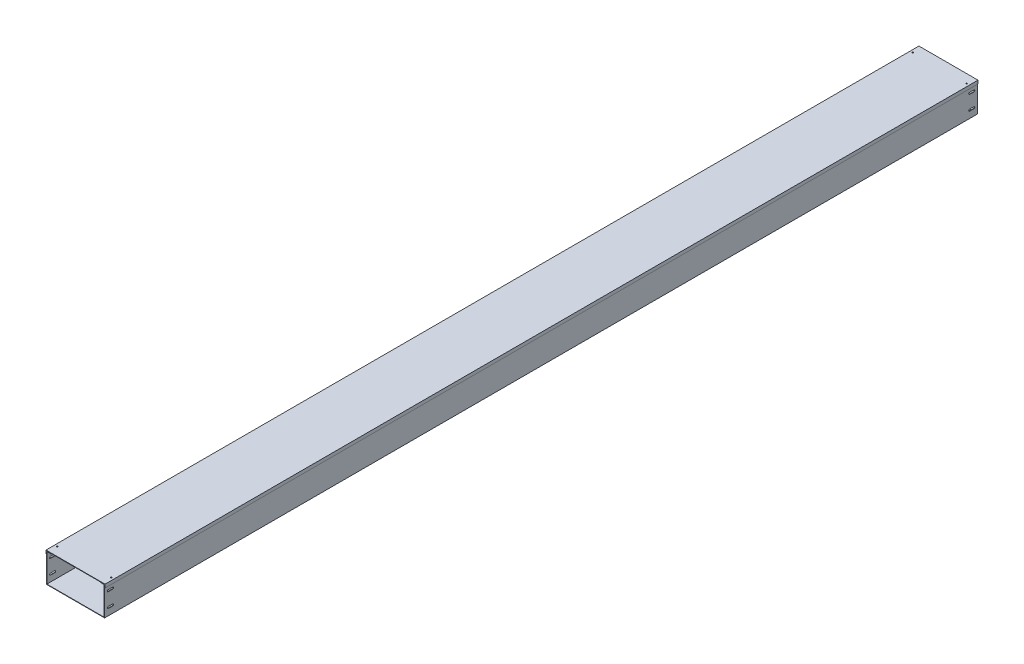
ISO-10303-21;
HEADER;
FILE_DESCRIPTION(('STEP AP214'),'2;1');
FILE_NAME('part.step','',(''),(''),'','','');
FILE_SCHEMA(('AUTOMOTIVE_DESIGN { 1 0 10303 214 1 1 1 1 }'));
ENDSEC;
DATA;
#1=APPLICATION_CONTEXT('core data for automotive mechanical design processes');
#2=APPLICATION_PROTOCOL_DEFINITION('international standard','automotive_design',2000,#1);
#3=PRODUCT_CONTEXT('',#1,'mechanical');
#4=PRODUCT('Part','Part','',(#3));
#5=PRODUCT_RELATED_PRODUCT_CATEGORY('part','',(#4));
#6=PRODUCT_DEFINITION_FORMATION('','',#4);
#7=PRODUCT_DEFINITION_CONTEXT('part definition',#1,'design');
#8=PRODUCT_DEFINITION('design','',#6,#7);
#9=PRODUCT_DEFINITION_SHAPE('','',#8);
#10=(LENGTH_UNIT() NAMED_UNIT(*) SI_UNIT(.MILLI.,.METRE.));
#11=(NAMED_UNIT(*) PLANE_ANGLE_UNIT() SI_UNIT($,.RADIAN.));
#12=(NAMED_UNIT(*) SI_UNIT($,.STERADIAN.) SOLID_ANGLE_UNIT());
#13=UNCERTAINTY_MEASURE_WITH_UNIT(LENGTH_MEASURE(1.E-05),#10,'distance_accuracy_value','');
#14=(GEOMETRIC_REPRESENTATION_CONTEXT(3) GLOBAL_UNCERTAINTY_ASSIGNED_CONTEXT((#13)) GLOBAL_UNIT_ASSIGNED_CONTEXT((#10,
#11,#12)) REPRESENTATION_CONTEXT('',''));
#15=CARTESIAN_POINT('',(0.,0.,0.));
#16=DIRECTION('',(0.,0.,1.));
#17=DIRECTION('',(1.,0.,0.));
#18=AXIS2_PLACEMENT_3D('',#15,#16,#17);
#19=CARTESIAN_POINT('',(100.,50.,3000.));
#20=DIRECTION('',(1.,0.,0.));
#21=DIRECTION('',(0.,0.,-1.));
#22=AXIS2_PLACEMENT_3D('',#19,#20,#21);
#23=PLANE('',#22);
#24=DIRECTION('',(0.,-1.,0.));
#25=VECTOR('',#24,1.);
#26=CARTESIAN_POINT('',(100.,50.,0.));
#27=LINE('',#26,#25);
#28=CARTESIAN_POINT('',(100.,50.,0.));
#29=VERTEX_POINT('',#28);
#30=CARTESIAN_POINT('',(100.,40.,0.));
#31=VERTEX_POINT('',#30);
#32=EDGE_CURVE('E139',#29,#31,#27,.T.);
#33=ORIENTED_EDGE('',*,*,#32,.T.);
#34=DIRECTION('',(0.,0.,-1.));
#35=VECTOR('',#34,1.);
#36=CARTESIAN_POINT('',(100.,40.,3000.));
#37=LINE('',#36,#35);
#38=CARTESIAN_POINT('',(100.,40.,3000.));
#39=VERTEX_POINT('',#38);
#40=EDGE_CURVE('E12',#39,#31,#37,.T.);
#41=ORIENTED_EDGE('',*,*,#40,.F.);
#42=DIRECTION('',(0.,-1.,0.));
#43=VECTOR('',#42,1.);
#44=CARTESIAN_POINT('',(100.,50.,3000.));
#45=LINE('',#44,#43);
#46=CARTESIAN_POINT('',(100.,50.,3000.));
#47=VERTEX_POINT('',#46);
#48=EDGE_CURVE('E97',#47,#39,#45,.T.);
#49=ORIENTED_EDGE('',*,*,#48,.F.);
#50=DIRECTION('',(0.,0.,-1.));
#51=VECTOR('',#50,1.);
#52=CARTESIAN_POINT('',(100.,50.,3000.));
#53=LINE('',#52,#51);
#54=EDGE_CURVE('E138',#47,#29,#53,.T.);
#55=ORIENTED_EDGE('',*,*,#54,.T.);
#56=EDGE_LOOP('',(#33,#41,#49,#55));
#57=FACE_BOUND('',#56,.T.);
#58=ADVANCED_FACE('F42',(#57),#23,.F.);
#59=CARTESIAN_POINT('',(101.5,40.,3000.));
#60=DIRECTION('',(0.,-1.,0.));
#61=DIRECTION('',(0.,0.,-1.));
#62=AXIS2_PLACEMENT_3D('',#59,#60,#61);
#63=PLANE('',#62);
#64=DIRECTION('',(-1.,0.,0.));
#65=VECTOR('',#64,1.);
#66=CARTESIAN_POINT('',(101.5,40.,0.));
#67=LINE('',#66,#65);
#68=CARTESIAN_POINT('',(101.5,40.,0.));
#69=VERTEX_POINT('',#68);
#70=EDGE_CURVE('E142',#69,#31,#67,.T.);
#71=ORIENTED_EDGE('',*,*,#70,.F.);
#72=DIRECTION('',(0.,0.,-1.));
#73=VECTOR('',#72,1.);
#74=CARTESIAN_POINT('',(101.5,40.,3000.));
#75=LINE('',#74,#73);
#76=CARTESIAN_POINT('',(101.5,40.,3000.));
#77=VERTEX_POINT('',#76);
#78=EDGE_CURVE('E50',#77,#69,#75,.T.);
#79=ORIENTED_EDGE('',*,*,#78,.F.);
#80=DIRECTION('',(-1.,0.,0.));
#81=VECTOR('',#80,1.);
#82=CARTESIAN_POINT('',(101.5,40.,3000.));
#83=LINE('',#82,#81);
#84=EDGE_CURVE('E182',#77,#39,#83,.T.);
#85=ORIENTED_EDGE('',*,*,#84,.T.);
#86=ORIENTED_EDGE('',*,*,#40,.T.);
#87=EDGE_LOOP('',(#71,#79,#85,#86));
#88=FACE_BOUND('',#87,.T.);
#89=ADVANCED_FACE('F173',(#88),#63,.T.);
#90=CARTESIAN_POINT('',(101.5,50.,3000.));
#91=DIRECTION('',(1.,0.,0.));
#92=DIRECTION('',(0.,0.,-1.));
#93=AXIS2_PLACEMENT_3D('',#90,#91,#92);
#94=PLANE('',#93);
#95=DIRECTION('',(0.,1.,0.));
#96=VECTOR('',#95,1.);
#97=CARTESIAN_POINT('',(101.5,50.,0.));
#98=LINE('',#97,#96);
#99=CARTESIAN_POINT('',(101.5,51.5,0.));
#100=VERTEX_POINT('',#99);
#101=EDGE_CURVE('E146',#100,#69,#98,.F.);
#102=ORIENTED_EDGE('',*,*,#101,.F.);
#103=DIRECTION('',(0.,0.,-1.));
#104=VECTOR('',#103,1.);
#105=CARTESIAN_POINT('',(101.5,51.5,3000.));
#106=LINE('',#105,#104);
#107=CARTESIAN_POINT('',(101.5,51.5,3000.));
#108=VERTEX_POINT('',#107);
#109=EDGE_CURVE('E163',#108,#100,#106,.T.);
#110=ORIENTED_EDGE('',*,*,#109,.F.);
#111=DIRECTION('',(0.,1.,0.));
#112=VECTOR('',#111,1.);
#113=CARTESIAN_POINT('',(101.5,50.,3000.));
#114=LINE('',#113,#112);
#115=EDGE_CURVE('E170',#108,#77,#114,.F.);
#116=ORIENTED_EDGE('',*,*,#115,.T.);
#117=ORIENTED_EDGE('',*,*,#78,.T.);
#118=EDGE_LOOP('',(#102,#110,#116,#117));
#119=FACE_BOUND('',#118,.T.);
#120=ADVANCED_FACE('F168',(#119),#94,.T.);
#121=CARTESIAN_POINT('',(-100.,51.5,3000.));
#122=DIRECTION('',(0.,1.,0.));
#123=DIRECTION('',(0.,0.,1.));
#124=AXIS2_PLACEMENT_3D('',#121,#122,#123);
#125=PLANE('',#124);
#126=CARTESIAN_POINT('',(92.5,51.5,2970.));
#127=DIRECTION('',(0.,1.,0.));
#128=DIRECTION('',(0.,0.,1.));
#129=AXIS2_PLACEMENT_3D('',#126,#127,#128);
#130=CIRCLE('',#129,1.99999999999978);
#131=CARTESIAN_POINT('',(92.5,51.5,2972.));
#132=VERTEX_POINT('',#131);
#133=EDGE_CURVE('E207',#132,#132,#130,.T.);
#134=ORIENTED_EDGE('',*,*,#133,.F.);
#135=EDGE_LOOP('',(#134));
#136=FACE_BOUND('',#135,.T.);
#137=CARTESIAN_POINT('',(-92.5,51.5,2970.));
#138=DIRECTION('',(0.,1.,0.));
#139=DIRECTION('',(0.,0.,1.));
#140=AXIS2_PLACEMENT_3D('',#137,#138,#139);
#141=CIRCLE('',#140,1.99999999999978);
#142=CARTESIAN_POINT('',(-92.5,51.5,2972.));
#143=VERTEX_POINT('',#142);
#144=EDGE_CURVE('E201',#143,#143,#141,.T.);
#145=ORIENTED_EDGE('',*,*,#144,.F.);
#146=EDGE_LOOP('',(#145));
#147=FACE_BOUND('',#146,.T.);
#148=CARTESIAN_POINT('',(-92.5,51.5,30.));
#149=DIRECTION('',(0.,-1.,0.));
#150=DIRECTION('',(0.,0.,-1.));
#151=AXIS2_PLACEMENT_3D('',#148,#149,#150);
#152=CIRCLE('',#151,1.99999999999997);
#153=CARTESIAN_POINT('',(-92.5,51.5,28.));
#154=VERTEX_POINT('',#153);
#155=EDGE_CURVE('E190',#154,#154,#152,.T.);
#156=ORIENTED_EDGE('',*,*,#155,.T.);
#157=EDGE_LOOP('',(#156));
#158=FACE_BOUND('',#157,.T.);
#159=CARTESIAN_POINT('',(92.5,51.5,30.));
#160=DIRECTION('',(0.,-1.,0.));
#161=DIRECTION('',(0.,0.,-1.));
#162=AXIS2_PLACEMENT_3D('',#159,#160,#161);
#163=CIRCLE('',#162,1.99999999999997);
#164=CARTESIAN_POINT('',(92.5,51.5,28.));
#165=VERTEX_POINT('',#164);
#166=EDGE_CURVE('E143',#165,#165,#163,.T.);
#167=ORIENTED_EDGE('',*,*,#166,.T.);
#168=EDGE_LOOP('',(#167));
#169=FACE_BOUND('',#168,.T.);
#170=DIRECTION('',(1.,0.,0.));
#171=VECTOR('',#170,1.);
#172=CARTESIAN_POINT('',(-100.,51.5,0.));
#173=LINE('',#172,#171);
#174=CARTESIAN_POINT('',(-101.5,51.5,0.));
#175=VERTEX_POINT('',#174);
#176=EDGE_CURVE('E149',#175,#100,#173,.T.);
#177=ORIENTED_EDGE('',*,*,#176,.F.);
#178=DIRECTION('',(0.,0.,-1.));
#179=VECTOR('',#178,1.);
#180=CARTESIAN_POINT('',(-101.5,51.5,3000.));
#181=LINE('',#180,#179);
#182=CARTESIAN_POINT('',(-101.5,51.5,3000.));
#183=VERTEX_POINT('',#182);
#184=EDGE_CURVE('E161',#183,#175,#181,.T.);
#185=ORIENTED_EDGE('',*,*,#184,.F.);
#186=DIRECTION('',(1.,0.,0.));
#187=VECTOR('',#186,1.);
#188=CARTESIAN_POINT('',(-100.,51.5,3000.));
#189=LINE('',#188,#187);
#190=EDGE_CURVE('E133',#183,#108,#189,.T.);
#191=ORIENTED_EDGE('',*,*,#190,.T.);
#192=ORIENTED_EDGE('',*,*,#109,.T.);
#193=EDGE_LOOP('',(#177,#185,#191,#192));
#194=FACE_BOUND('',#193,.T.);
#195=ADVANCED_FACE('F180',(#136,#147,#158,#169,#194),#125,.T.);
#196=CARTESIAN_POINT('',(-101.5,40.,3000.));
#197=DIRECTION('',(-1.,0.,0.));
#198=DIRECTION('',(0.,0.,1.));
#199=AXIS2_PLACEMENT_3D('',#196,#197,#198);
#200=PLANE('',#199);
#201=DIRECTION('',(0.,1.,0.));
#202=VECTOR('',#201,1.);
#203=CARTESIAN_POINT('',(-101.5,40.,0.));
#204=LINE('',#203,#202);
#205=CARTESIAN_POINT('',(-101.5,40.,0.));
#206=VERTEX_POINT('',#205);
#207=EDGE_CURVE('E152',#206,#175,#204,.T.);
#208=ORIENTED_EDGE('',*,*,#207,.F.);
#209=DIRECTION('',(0.,0.,-1.));
#210=VECTOR('',#209,1.);
#211=CARTESIAN_POINT('',(-101.5,40.,3000.));
#212=LINE('',#211,#210);
#213=CARTESIAN_POINT('',(-101.5,40.,3000.));
#214=VERTEX_POINT('',#213);
#215=EDGE_CURVE('E121',#214,#206,#212,.T.);
#216=ORIENTED_EDGE('',*,*,#215,.F.);
#217=DIRECTION('',(0.,1.,0.));
#218=VECTOR('',#217,1.);
#219=CARTESIAN_POINT('',(-101.5,40.,3000.));
#220=LINE('',#219,#218);
#221=EDGE_CURVE('E131',#214,#183,#220,.T.);
#222=ORIENTED_EDGE('',*,*,#221,.T.);
#223=ORIENTED_EDGE('',*,*,#184,.T.);
#224=EDGE_LOOP('',(#208,#216,#222,#223));
#225=FACE_BOUND('',#224,.T.);
#226=ADVANCED_FACE('F216',(#225),#200,.T.);
#227=CARTESIAN_POINT('',(-100.,40.,3000.));
#228=DIRECTION('',(0.,-1.,0.));
#229=DIRECTION('',(0.,0.,-1.));
#230=AXIS2_PLACEMENT_3D('',#227,#228,#229);
#231=PLANE('',#230);
#232=DIRECTION('',(-1.,0.,0.));
#233=VECTOR('',#232,1.);
#234=CARTESIAN_POINT('',(-100.,40.,0.));
#235=LINE('',#234,#233);
#236=CARTESIAN_POINT('',(-100.,40.,0.));
#237=VERTEX_POINT('',#236);
#238=EDGE_CURVE('E120',#237,#206,#235,.T.);
#239=ORIENTED_EDGE('',*,*,#238,.F.);
#240=DIRECTION('',(0.,0.,-1.));
#241=VECTOR('',#240,1.);
#242=CARTESIAN_POINT('',(-100.,40.,3000.));
#243=LINE('',#242,#241);
#244=CARTESIAN_POINT('',(-100.,40.,3000.));
#245=VERTEX_POINT('',#244);
#246=EDGE_CURVE('E114',#245,#237,#243,.T.);
#247=ORIENTED_EDGE('',*,*,#246,.F.);
#248=DIRECTION('',(-1.,0.,0.));
#249=VECTOR('',#248,1.);
#250=CARTESIAN_POINT('',(-100.,40.,3000.));
#251=LINE('',#250,#249);
#252=EDGE_CURVE('E118',#245,#214,#251,.T.);
#253=ORIENTED_EDGE('',*,*,#252,.T.);
#254=ORIENTED_EDGE('',*,*,#215,.T.);
#255=EDGE_LOOP('',(#239,#247,#253,#254));
#256=FACE_BOUND('',#255,.T.);
#257=ADVANCED_FACE('F116',(#256),#231,.T.);
#258=CARTESIAN_POINT('',(-100.,40.,3000.));
#259=DIRECTION('',(-1.,0.,0.));
#260=DIRECTION('',(0.,0.,1.));
#261=AXIS2_PLACEMENT_3D('',#258,#259,#260);
#262=PLANE('',#261);
#263=DIRECTION('',(0.,1.,0.));
#264=VECTOR('',#263,1.);
#265=CARTESIAN_POINT('',(-100.,40.,0.));
#266=LINE('',#265,#264);
#267=CARTESIAN_POINT('',(-100.,50.,0.));
#268=VERTEX_POINT('',#267);
#269=EDGE_CURVE('E85',#237,#268,#266,.T.);
#270=ORIENTED_EDGE('',*,*,#269,.T.);
#271=DIRECTION('',(0.,0.,-1.));
#272=VECTOR('',#271,1.);
#273=CARTESIAN_POINT('',(-100.,50.,3000.));
#274=LINE('',#273,#272);
#275=CARTESIAN_POINT('',(-100.,50.,3000.));
#276=VERTEX_POINT('',#275);
#277=EDGE_CURVE('E122',#276,#268,#274,.T.);
#278=ORIENTED_EDGE('',*,*,#277,.F.);
#279=DIRECTION('',(0.,1.,0.));
#280=VECTOR('',#279,1.);
#281=CARTESIAN_POINT('',(-100.,40.,3000.));
#282=LINE('',#281,#280);
#283=EDGE_CURVE('E124',#245,#276,#282,.T.);
#284=ORIENTED_EDGE('',*,*,#283,.F.);
#285=ORIENTED_EDGE('',*,*,#246,.T.);
#286=EDGE_LOOP('',(#270,#278,#284,#285));
#287=FACE_BOUND('',#286,.T.);
#288=ADVANCED_FACE('F125',(#287),#262,.F.);
#289=CARTESIAN_POINT('',(-100.,50.,3000.));
#290=DIRECTION('',(0.,1.,0.));
#291=DIRECTION('',(0.,0.,1.));
#292=AXIS2_PLACEMENT_3D('',#289,#290,#291);
#293=PLANE('',#292);
#294=CARTESIAN_POINT('',(92.5,50.,2970.));
#295=DIRECTION('',(0.,1.,0.));
#296=DIRECTION('',(0.,0.,1.));
#297=AXIS2_PLACEMENT_3D('',#294,#295,#296);
#298=CIRCLE('',#297,1.99999999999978);
#299=CARTESIAN_POINT('',(92.5,50.,2972.));
#300=VERTEX_POINT('',#299);
#301=EDGE_CURVE('E204',#300,#300,#298,.F.);
#302=ORIENTED_EDGE('',*,*,#301,.F.);
#303=EDGE_LOOP('',(#302));
#304=FACE_BOUND('',#303,.T.);
#305=CARTESIAN_POINT('',(-92.5,50.,2970.));
#306=DIRECTION('',(0.,1.,0.));
#307=DIRECTION('',(0.,0.,1.));
#308=AXIS2_PLACEMENT_3D('',#305,#306,#307);
#309=CIRCLE('',#308,1.99999999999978);
#310=CARTESIAN_POINT('',(-92.5,50.,2972.));
#311=VERTEX_POINT('',#310);
#312=EDGE_CURVE('E196',#311,#311,#309,.F.);
#313=ORIENTED_EDGE('',*,*,#312,.F.);
#314=EDGE_LOOP('',(#313));
#315=FACE_BOUND('',#314,.T.);
#316=CARTESIAN_POINT('',(-92.5,50.,30.));
#317=DIRECTION('',(0.,1.,0.));
#318=DIRECTION('',(0.,0.,1.));
#319=AXIS2_PLACEMENT_3D('',#316,#317,#318);
#320=CIRCLE('',#319,1.99999999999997);
#321=CARTESIAN_POINT('',(-92.5,50.,32.));
#322=VERTEX_POINT('',#321);
#323=EDGE_CURVE('E193',#322,#322,#320,.T.);
#324=ORIENTED_EDGE('',*,*,#323,.T.);
#325=EDGE_LOOP('',(#324));
#326=FACE_BOUND('',#325,.T.);
#327=CARTESIAN_POINT('',(92.5,50.,30.));
#328=DIRECTION('',(0.,1.,0.));
#329=DIRECTION('',(0.,0.,1.));
#330=AXIS2_PLACEMENT_3D('',#327,#328,#329);
#331=CIRCLE('',#330,1.99999999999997);
#332=CARTESIAN_POINT('',(92.5,50.,32.));
#333=VERTEX_POINT('',#332);
#334=EDGE_CURVE('E187',#333,#333,#331,.T.);
#335=ORIENTED_EDGE('',*,*,#334,.T.);
#336=EDGE_LOOP('',(#335));
#337=FACE_BOUND('',#336,.T.);
#338=DIRECTION('',(1.,0.,0.));
#339=VECTOR('',#338,1.);
#340=CARTESIAN_POINT('',(-100.,50.,0.));
#341=LINE('',#340,#339);
#342=EDGE_CURVE('E91',#268,#29,#341,.T.);
#343=ORIENTED_EDGE('',*,*,#342,.T.);
#344=ORIENTED_EDGE('',*,*,#54,.F.);
#345=DIRECTION('',(1.,0.,0.));
#346=VECTOR('',#345,1.);
#347=CARTESIAN_POINT('',(-100.,50.,3000.));
#348=LINE('',#347,#346);
#349=EDGE_CURVE('E58',#276,#47,#348,.T.);
#350=ORIENTED_EDGE('',*,*,#349,.F.);
#351=ORIENTED_EDGE('',*,*,#277,.T.);
#352=EDGE_LOOP('',(#343,#344,#350,#351));
#353=FACE_BOUND('',#352,.T.);
#354=ADVANCED_FACE('F231',(#304,#315,#326,#337,#353),#293,.F.);
#355=CARTESIAN_POINT('',(0.,0.,3000.));
#356=DIRECTION('',(0.,0.,-1.));
#357=DIRECTION('',(-1.,0.,0.));
#358=AXIS2_PLACEMENT_3D('',#355,#356,#357);
#359=PLANE('',#358);
#360=ORIENTED_EDGE('',*,*,#48,.T.);
#361=ORIENTED_EDGE('',*,*,#84,.F.);
#362=ORIENTED_EDGE('',*,*,#115,.F.);
#363=ORIENTED_EDGE('',*,*,#190,.F.);
#364=ORIENTED_EDGE('',*,*,#221,.F.);
#365=ORIENTED_EDGE('',*,*,#252,.F.);
#366=ORIENTED_EDGE('',*,*,#283,.T.);
#367=ORIENTED_EDGE('',*,*,#349,.T.);
#368=EDGE_LOOP('',(#360,#361,#362,#363,#364,#365,#366,#367));
#369=FACE_BOUND('',#368,.T.);
#370=ADVANCED_FACE('F128',(#369),#359,.F.);
#371=CARTESIAN_POINT('',(0.,0.,0.));
#372=DIRECTION('',(0.,0.,-1.));
#373=DIRECTION('',(-1.,0.,0.));
#374=AXIS2_PLACEMENT_3D('',#371,#372,#373);
#375=PLANE('',#374);
#376=ORIENTED_EDGE('',*,*,#32,.F.);
#377=ORIENTED_EDGE('',*,*,#342,.F.);
#378=ORIENTED_EDGE('',*,*,#269,.F.);
#379=ORIENTED_EDGE('',*,*,#238,.T.);
#380=ORIENTED_EDGE('',*,*,#207,.T.);
#381=ORIENTED_EDGE('',*,*,#176,.T.);
#382=ORIENTED_EDGE('',*,*,#101,.T.);
#383=ORIENTED_EDGE('',*,*,#70,.T.);
#384=EDGE_LOOP('',(#376,#377,#378,#379,#380,#381,#382,#383));
#385=FACE_BOUND('',#384,.T.);
#386=ADVANCED_FACE('F176',(#385),#375,.T.);
#387=CARTESIAN_POINT('',(92.5,-50.001,30.));
#388=DIRECTION('',(0.,1.,0.));
#389=DIRECTION('',(0.,0.,1.));
#390=AXIS2_PLACEMENT_3D('',#387,#388,#389);
#391=CYLINDRICAL_SURFACE('',#390,1.99999999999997);
#392=ORIENTED_EDGE('',*,*,#166,.F.);
#393=EDGE_LOOP('',(#392));
#394=FACE_BOUND('',#393,.T.);
#395=ORIENTED_EDGE('',*,*,#334,.F.);
#396=EDGE_LOOP('',(#395));
#397=FACE_BOUND('',#396,.T.);
#398=ADVANCED_FACE('F224',(#394,#397),#391,.F.);
#399=CARTESIAN_POINT('',(-92.5,-50.001,30.));
#400=DIRECTION('',(0.,1.,0.));
#401=DIRECTION('',(0.,0.,1.));
#402=AXIS2_PLACEMENT_3D('',#399,#400,#401);
#403=CYLINDRICAL_SURFACE('',#402,1.99999999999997);
#404=ORIENTED_EDGE('',*,*,#155,.F.);
#405=EDGE_LOOP('',(#404));
#406=FACE_BOUND('',#405,.T.);
#407=ORIENTED_EDGE('',*,*,#323,.F.);
#408=EDGE_LOOP('',(#407));
#409=FACE_BOUND('',#408,.T.);
#410=ADVANCED_FACE('F227',(#406,#409),#403,.F.);
#411=CARTESIAN_POINT('',(-92.5,-50.001,2970.));
#412=DIRECTION('',(0.,1.,0.));
#413=DIRECTION('',(0.,0.,1.));
#414=AXIS2_PLACEMENT_3D('',#411,#412,#413);
#415=CYLINDRICAL_SURFACE('',#414,1.99999999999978);
#416=ORIENTED_EDGE('',*,*,#144,.T.);
#417=EDGE_LOOP('',(#416));
#418=FACE_BOUND('',#417,.T.);
#419=ORIENTED_EDGE('',*,*,#312,.T.);
#420=EDGE_LOOP('',(#419));
#421=FACE_BOUND('',#420,.T.);
#422=ADVANCED_FACE('F295',(#418,#421),#415,.F.);
#423=CARTESIAN_POINT('',(92.5,-50.001,2970.));
#424=DIRECTION('',(0.,1.,0.));
#425=DIRECTION('',(0.,0.,1.));
#426=AXIS2_PLACEMENT_3D('',#423,#424,#425);
#427=CYLINDRICAL_SURFACE('',#426,1.99999999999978);
#428=ORIENTED_EDGE('',*,*,#133,.T.);
#429=EDGE_LOOP('',(#428));
#430=FACE_BOUND('',#429,.T.);
#431=ORIENTED_EDGE('',*,*,#301,.T.);
#432=EDGE_LOOP('',(#431));
#433=FACE_BOUND('',#432,.T.);
#434=ADVANCED_FACE('F211',(#430,#433),#427,.F.);
#435=CLOSED_SHELL('',(#58,#89,#120,#195,#226,#257,#288,#354,#370,#386,#398,#410,#422,#434));
#436=MANIFOLD_SOLID_BREP('B2',#435);
#437=CARTESIAN_POINT('',(100.,50.,3000.));
#438=DIRECTION('',(0.,-1.,0.));
#439=DIRECTION('',(1.,0.,0.));
#440=AXIS2_PLACEMENT_3D('',#437,#438,#439);
#441=PLANE('',#440);
#442=CARTESIAN_POINT('',(92.5,50.,2970.));
#443=DIRECTION('',(0.,1.,0.));
#444=DIRECTION('',(0.,0.,1.));
#445=AXIS2_PLACEMENT_3D('',#442,#443,#444);
#446=CIRCLE('',#445,2.);
#447=CARTESIAN_POINT('',(92.5,50.,2972.));
#448=VERTEX_POINT('',#447);
#449=EDGE_CURVE('E1025',#448,#448,#446,.T.);
#450=ORIENTED_EDGE('',*,*,#449,.F.);
#451=EDGE_LOOP('',(#450));
#452=FACE_BOUND('',#451,.T.);
#453=CARTESIAN_POINT('',(92.5,50.,30.));
#454=DIRECTION('',(0.,1.,0.));
#455=DIRECTION('',(0.,0.,1.));
#456=AXIS2_PLACEMENT_3D('',#453,#454,#455);
#457=CIRCLE('',#456,2.);
#458=CARTESIAN_POINT('',(92.5,50.,32.));
#459=VERTEX_POINT('',#458);
#460=EDGE_CURVE('E1028',#459,#459,#457,.T.);
#461=ORIENTED_EDGE('',*,*,#460,.F.);
#462=EDGE_LOOP('',(#461));
#463=FACE_BOUND('',#462,.T.);
#464=DIRECTION('',(-1.,0.,0.));
#465=VECTOR('',#464,1.);
#466=CARTESIAN_POINT('',(100.,50.,0.));
#467=LINE('',#466,#465);
#468=CARTESIAN_POINT('',(100.,50.,0.));
#469=VERTEX_POINT('',#468);
#470=CARTESIAN_POINT('',(85.,50.,0.));
#471=VERTEX_POINT('',#470);
#472=EDGE_CURVE('E864',#469,#471,#467,.T.);
#473=ORIENTED_EDGE('',*,*,#472,.T.);
#474=DIRECTION('',(0.,0.,-1.));
#475=VECTOR('',#474,1.);
#476=CARTESIAN_POINT('',(85.,50.,3000.));
#477=LINE('',#476,#475);
#478=CARTESIAN_POINT('',(85.,50.,3000.));
#479=VERTEX_POINT('',#478);
#480=EDGE_CURVE('E40',#479,#471,#477,.T.);
#481=ORIENTED_EDGE('',*,*,#480,.F.);
#482=DIRECTION('',(-1.,0.,0.));
#483=VECTOR('',#482,1.);
#484=CARTESIAN_POINT('',(100.,50.,3000.));
#485=LINE('',#484,#483);
#486=CARTESIAN_POINT('',(100.,50.,3000.));
#487=VERTEX_POINT('',#486);
#488=EDGE_CURVE('E865',#487,#479,#485,.T.);
#489=ORIENTED_EDGE('',*,*,#488,.F.);
#490=DIRECTION('',(0.,0.,-1.));
#491=VECTOR('',#490,1.);
#492=CARTESIAN_POINT('',(100.,50.,3000.));
#493=LINE('',#492,#491);
#494=EDGE_CURVE('E897',#487,#469,#493,.T.);
#495=ORIENTED_EDGE('',*,*,#494,.T.);
#496=EDGE_LOOP('',(#473,#481,#489,#495));
#497=FACE_BOUND('',#496,.T.);
#498=ADVANCED_FACE('F353',(#452,#463,#497),#441,.F.);
#499=CARTESIAN_POINT('',(85.,48.5,3000.));
#500=DIRECTION('',(-1.,0.,0.));
#501=DIRECTION('',(0.,0.,1.));
#502=AXIS2_PLACEMENT_3D('',#499,#500,#501);
#503=PLANE('',#502);
#504=DIRECTION('',(0.,1.,0.));
#505=VECTOR('',#504,1.);
#506=CARTESIAN_POINT('',(85.,48.5,0.));
#507=LINE('',#506,#505);
#508=CARTESIAN_POINT('',(85.,48.5,0.));
#509=VERTEX_POINT('',#508);
#510=EDGE_CURVE('E900',#509,#471,#507,.T.);
#511=ORIENTED_EDGE('',*,*,#510,.F.);
#512=DIRECTION('',(0.,0.,-1.));
#513=VECTOR('',#512,1.);
#514=CARTESIAN_POINT('',(85.,48.5,3000.));
#515=LINE('',#514,#513);
#516=CARTESIAN_POINT('',(85.,48.5,3000.));
#517=VERTEX_POINT('',#516);
#518=EDGE_CURVE('E360',#517,#509,#515,.T.);
#519=ORIENTED_EDGE('',*,*,#518,.F.);
#520=DIRECTION('',(0.,1.,0.));
#521=VECTOR('',#520,1.);
#522=CARTESIAN_POINT('',(85.,48.5,3000.));
#523=LINE('',#522,#521);
#524=EDGE_CURVE('E867',#517,#479,#523,.T.);
#525=ORIENTED_EDGE('',*,*,#524,.T.);
#526=ORIENTED_EDGE('',*,*,#480,.T.);
#527=EDGE_LOOP('',(#511,#519,#525,#526));
#528=FACE_BOUND('',#527,.T.);
#529=ADVANCED_FACE('F957',(#528),#503,.T.);
#530=CARTESIAN_POINT('',(100.,48.5,3000.));
#531=DIRECTION('',(0.,-1.,0.));
#532=DIRECTION('',(1.,0.,0.));
#533=AXIS2_PLACEMENT_3D('',#530,#531,#532);
#534=PLANE('',#533);
#535=CARTESIAN_POINT('',(92.5,48.5,2970.));
#536=DIRECTION('',(0.,-1.,0.));
#537=DIRECTION('',(1.,0.,0.));
#538=AXIS2_PLACEMENT_3D('',#535,#536,#537);
#539=CIRCLE('',#538,2.);
#540=CARTESIAN_POINT('',(94.5,48.5,2970.));
#541=VERTEX_POINT('',#540);
#542=EDGE_CURVE('E1502',#541,#541,#539,.F.);
#543=ORIENTED_EDGE('',*,*,#542,.T.);
#544=EDGE_LOOP('',(#543));
#545=FACE_BOUND('',#544,.T.);
#546=CARTESIAN_POINT('',(92.5,48.5,30.));
#547=DIRECTION('',(0.,-1.,0.));
#548=DIRECTION('',(1.,0.,0.));
#549=AXIS2_PLACEMENT_3D('',#546,#547,#548);
#550=CIRCLE('',#549,2.);
#551=CARTESIAN_POINT('',(94.5,48.5,30.));
#552=VERTEX_POINT('',#551);
#553=EDGE_CURVE('E1031',#552,#552,#550,.F.);
#554=ORIENTED_EDGE('',*,*,#553,.T.);
#555=EDGE_LOOP('',(#554));
#556=FACE_BOUND('',#555,.T.);
#557=DIRECTION('',(-1.,0.,0.));
#558=VECTOR('',#557,1.);
#559=CARTESIAN_POINT('',(100.,48.5,0.));
#560=LINE('',#559,#558);
#561=CARTESIAN_POINT('',(98.5,48.5,0.));
#562=VERTEX_POINT('',#561);
#563=EDGE_CURVE('E903',#562,#509,#560,.T.);
#564=ORIENTED_EDGE('',*,*,#563,.F.);
#565=DIRECTION('',(0.,0.,-1.));
#566=VECTOR('',#565,1.);
#567=CARTESIAN_POINT('',(98.5,48.5,3000.));
#568=LINE('',#567,#566);
#569=CARTESIAN_POINT('',(98.5,48.5,3000.));
#570=VERTEX_POINT('',#569);
#571=EDGE_CURVE('E949',#570,#562,#568,.T.);
#572=ORIENTED_EDGE('',*,*,#571,.F.);
#573=DIRECTION('',(-1.,0.,0.));
#574=VECTOR('',#573,1.);
#575=CARTESIAN_POINT('',(100.,48.5,3000.));
#576=LINE('',#575,#574);
#577=EDGE_CURVE('E871',#570,#517,#576,.T.);
#578=ORIENTED_EDGE('',*,*,#577,.T.);
#579=ORIENTED_EDGE('',*,*,#518,.T.);
#580=EDGE_LOOP('',(#564,#572,#578,#579));
#581=FACE_BOUND('',#580,.T.);
#582=ADVANCED_FACE('F953',(#545,#556,#581),#534,.T.);
#583=CARTESIAN_POINT('',(98.5,-50.,3000.));
#584=DIRECTION('',(-1.,0.,0.));
#585=DIRECTION('',(0.,0.,1.));
#586=AXIS2_PLACEMENT_3D('',#583,#584,#585);
#587=PLANE('',#586);
#588=CARTESIAN_POINT('',(98.5,-24.9999999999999,2987.5));
#589=DIRECTION('',(-1.,0.,0.));
#590=DIRECTION('',(0.,0.,1.));
#591=AXIS2_PLACEMENT_3D('',#588,#589,#590);
#592=CIRCLE('',#591,3.);
#593=CARTESIAN_POINT('',(98.5,-27.9999999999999,2987.5));
#594=VERTEX_POINT('',#593);
#595=CARTESIAN_POINT('',(98.5,-21.9999999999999,2987.5));
#596=VERTEX_POINT('',#595);
#597=EDGE_CURVE('E694',#594,#596,#592,.T.);
#598=ORIENTED_EDGE('',*,*,#597,.F.);
#599=DIRECTION('',(0.,0.,1.));
#600=VECTOR('',#599,1.);
#601=CARTESIAN_POINT('',(98.5,-27.9999999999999,3000.));
#602=LINE('',#601,#600);
#603=CARTESIAN_POINT('',(98.5,-27.9999999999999,2972.5));
#604=VERTEX_POINT('',#603);
#605=EDGE_CURVE('E683',#604,#594,#602,.T.);
#606=ORIENTED_EDGE('',*,*,#605,.F.);
#607=CARTESIAN_POINT('',(98.5,-24.9999999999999,2972.5));
#608=DIRECTION('',(-1.,0.,0.));
#609=DIRECTION('',(0.,0.,1.));
#610=AXIS2_PLACEMENT_3D('',#607,#608,#609);
#611=CIRCLE('',#610,3.);
#612=CARTESIAN_POINT('',(98.5,-21.9999999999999,2972.5));
#613=VERTEX_POINT('',#612);
#614=EDGE_CURVE('E637',#613,#604,#611,.T.);
#615=ORIENTED_EDGE('',*,*,#614,.F.);
#616=DIRECTION('',(0.,0.,-1.));
#617=VECTOR('',#616,1.);
#618=CARTESIAN_POINT('',(98.5,-21.9999999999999,3000.));
#619=LINE('',#618,#617);
#620=EDGE_CURVE('E690',#596,#613,#619,.T.);
#621=ORIENTED_EDGE('',*,*,#620,.F.);
#622=EDGE_LOOP('',(#598,#606,#615,#621));
#623=FACE_BOUND('',#622,.T.);
#624=CARTESIAN_POINT('',(98.5,25.0000000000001,2987.5));
#625=DIRECTION('',(-1.,0.,0.));
#626=DIRECTION('',(0.,0.,1.));
#627=AXIS2_PLACEMENT_3D('',#624,#625,#626);
#628=CIRCLE('',#627,3.);
#629=CARTESIAN_POINT('',(98.5,22.0000000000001,2987.5));
#630=VERTEX_POINT('',#629);
#631=CARTESIAN_POINT('',(98.5,28.0000000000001,2987.5));
#632=VERTEX_POINT('',#631);
#633=EDGE_CURVE('E750',#630,#632,#628,.T.);
#634=ORIENTED_EDGE('',*,*,#633,.F.);
#635=DIRECTION('',(0.,0.,1.));
#636=VECTOR('',#635,1.);
#637=CARTESIAN_POINT('',(98.5,22.0000000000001,3000.));
#638=LINE('',#637,#636);
#639=CARTESIAN_POINT('',(98.5,22.0000000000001,2972.5));
#640=VERTEX_POINT('',#639);
#641=EDGE_CURVE('E736',#640,#630,#638,.T.);
#642=ORIENTED_EDGE('',*,*,#641,.F.);
#643=CARTESIAN_POINT('',(98.5,25.0000000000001,2972.5));
#644=DIRECTION('',(-1.,0.,0.));
#645=DIRECTION('',(0.,0.,1.));
#646=AXIS2_PLACEMENT_3D('',#643,#644,#645);
#647=CIRCLE('',#646,3.);
#648=CARTESIAN_POINT('',(98.5,28.0000000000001,2972.5));
#649=VERTEX_POINT('',#648);
#650=EDGE_CURVE('E740',#649,#640,#647,.T.);
#651=ORIENTED_EDGE('',*,*,#650,.F.);
#652=DIRECTION('',(0.,0.,-1.));
#653=VECTOR('',#652,1.);
#654=CARTESIAN_POINT('',(98.5,28.0000000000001,3000.));
#655=LINE('',#654,#653);
#656=EDGE_CURVE('E745',#632,#649,#655,.T.);
#657=ORIENTED_EDGE('',*,*,#656,.F.);
#658=EDGE_LOOP('',(#634,#642,#651,#657));
#659=FACE_BOUND('',#658,.T.);
#660=CARTESIAN_POINT('',(98.5,-25.,27.5));
#661=DIRECTION('',(-1.,0.,0.));
#662=DIRECTION('',(0.,0.,1.));
#663=AXIS2_PLACEMENT_3D('',#660,#661,#662);
#664=CIRCLE('',#663,3.);
#665=CARTESIAN_POINT('',(98.5,-28.,27.5));
#666=VERTEX_POINT('',#665);
#667=CARTESIAN_POINT('',(98.5,-22.,27.5));
#668=VERTEX_POINT('',#667);
#669=EDGE_CURVE('E806',#666,#668,#664,.T.);
#670=ORIENTED_EDGE('',*,*,#669,.F.);
#671=DIRECTION('',(0.,0.,1.));
#672=VECTOR('',#671,1.);
#673=CARTESIAN_POINT('',(98.5,-28.0000000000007,3000.));
#674=LINE('',#673,#672);
#675=CARTESIAN_POINT('',(98.5,-28.,12.5000000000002));
#676=VERTEX_POINT('',#675);
#677=EDGE_CURVE('E792',#676,#666,#674,.T.);
#678=ORIENTED_EDGE('',*,*,#677,.F.);
#679=CARTESIAN_POINT('',(98.5,-25.,12.5));
#680=DIRECTION('',(-1.,0.,0.));
#681=DIRECTION('',(0.,0.,1.));
#682=AXIS2_PLACEMENT_3D('',#679,#680,#681);
#683=CIRCLE('',#682,3.);
#684=CARTESIAN_POINT('',(98.5,-22.,12.5));
#685=VERTEX_POINT('',#684);
#686=EDGE_CURVE('E796',#685,#676,#683,.T.);
#687=ORIENTED_EDGE('',*,*,#686,.F.);
#688=DIRECTION('',(0.,0.,-1.));
#689=VECTOR('',#688,1.);
#690=CARTESIAN_POINT('',(98.5,-22.0000000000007,3000.));
#691=LINE('',#690,#689);
#692=EDGE_CURVE('E801',#668,#685,#691,.T.);
#693=ORIENTED_EDGE('',*,*,#692,.F.);
#694=EDGE_LOOP('',(#670,#678,#687,#693));
#695=FACE_BOUND('',#694,.T.);
#696=CARTESIAN_POINT('',(98.5,25.0000000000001,27.5000000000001));
#697=DIRECTION('',(-1.,0.,0.));
#698=DIRECTION('',(0.,0.,1.));
#699=AXIS2_PLACEMENT_3D('',#696,#697,#698);
#700=CIRCLE('',#699,3.);
#701=CARTESIAN_POINT('',(98.5,22.0000000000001,27.5000000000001));
#702=VERTEX_POINT('',#701);
#703=CARTESIAN_POINT('',(98.5,28.0000000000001,27.5000000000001));
#704=VERTEX_POINT('',#703);
#705=EDGE_CURVE('E862',#702,#704,#700,.T.);
#706=ORIENTED_EDGE('',*,*,#705,.F.);
#707=DIRECTION('',(0.,0.,1.));
#708=VECTOR('',#707,1.);
#709=CARTESIAN_POINT('',(98.5,22.0000000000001,3000.));
#710=LINE('',#709,#708);
#711=CARTESIAN_POINT('',(98.5,22.0000000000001,12.5000000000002));
#712=VERTEX_POINT('',#711);
#713=EDGE_CURVE('E848',#712,#702,#710,.T.);
#714=ORIENTED_EDGE('',*,*,#713,.F.);
#715=CARTESIAN_POINT('',(98.5,25.0000000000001,12.5000000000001));
#716=DIRECTION('',(-1.,0.,0.));
#717=DIRECTION('',(0.,0.,1.));
#718=AXIS2_PLACEMENT_3D('',#715,#716,#717);
#719=CIRCLE('',#718,3.);
#720=CARTESIAN_POINT('',(98.5,28.0000000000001,12.5000000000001));
#721=VERTEX_POINT('',#720);
#722=EDGE_CURVE('E852',#721,#712,#719,.T.);
#723=ORIENTED_EDGE('',*,*,#722,.F.);
#724=DIRECTION('',(0.,0.,-1.));
#725=VECTOR('',#724,1.);
#726=CARTESIAN_POINT('',(98.5,28.0000000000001,3000.));
#727=LINE('',#726,#725);
#728=EDGE_CURVE('E857',#704,#721,#727,.T.);
#729=ORIENTED_EDGE('',*,*,#728,.F.);
#730=EDGE_LOOP('',(#706,#714,#723,#729));
#731=FACE_BOUND('',#730,.T.);
#732=DIRECTION('',(0.,1.,0.));
#733=VECTOR('',#732,1.);
#734=CARTESIAN_POINT('',(98.5,-50.,0.));
#735=LINE('',#734,#733);
#736=CARTESIAN_POINT('',(98.5,-48.5,0.));
#737=VERTEX_POINT('',#736);
#738=EDGE_CURVE('E906',#737,#562,#735,.T.);
#739=ORIENTED_EDGE('',*,*,#738,.F.);
#740=DIRECTION('',(0.,0.,-1.));
#741=VECTOR('',#740,1.);
#742=CARTESIAN_POINT('',(98.5,-48.5,3000.));
#743=LINE('',#742,#741);
#744=CARTESIAN_POINT('',(98.5,-48.5,3000.));
#745=VERTEX_POINT('',#744);
#746=EDGE_CURVE('E947',#745,#737,#743,.T.);
#747=ORIENTED_EDGE('',*,*,#746,.F.);
#748=DIRECTION('',(0.,1.,0.));
#749=VECTOR('',#748,1.);
#750=CARTESIAN_POINT('',(98.5,-50.,3000.));
#751=LINE('',#750,#749);
#752=EDGE_CURVE('E874',#745,#570,#751,.T.);
#753=ORIENTED_EDGE('',*,*,#752,.T.);
#754=ORIENTED_EDGE('',*,*,#571,.T.);
#755=EDGE_LOOP('',(#739,#747,#753,#754));
#756=FACE_BOUND('',#755,.T.);
#757=ADVANCED_FACE('F965',(#623,#659,#695,#731,#756),#587,.T.);
#758=CARTESIAN_POINT('',(-100.,-48.5,3000.));
#759=DIRECTION('',(0.,1.,0.));
#760=DIRECTION('',(0.,0.,1.));
#761=AXIS2_PLACEMENT_3D('',#758,#759,#760);
#762=PLANE('',#761);
#763=DIRECTION('',(1.,0.,0.));
#764=VECTOR('',#763,1.);
#765=CARTESIAN_POINT('',(-100.,-48.5,0.));
#766=LINE('',#765,#764);
#767=CARTESIAN_POINT('',(-98.5,-48.5,0.));
#768=VERTEX_POINT('',#767);
#769=EDGE_CURVE('E909',#768,#737,#766,.T.);
#770=ORIENTED_EDGE('',*,*,#769,.F.);
#771=DIRECTION('',(0.,0.,-1.));
#772=VECTOR('',#771,1.);
#773=CARTESIAN_POINT('',(-98.5,-48.5,3000.));
#774=LINE('',#773,#772);
#775=CARTESIAN_POINT('',(-98.5,-48.5,3000.));
#776=VERTEX_POINT('',#775);
#777=EDGE_CURVE('E945',#776,#768,#774,.T.);
#778=ORIENTED_EDGE('',*,*,#777,.F.);
#779=DIRECTION('',(1.,0.,0.));
#780=VECTOR('',#779,1.);
#781=CARTESIAN_POINT('',(-100.,-48.5,3000.));
#782=LINE('',#781,#780);
#783=EDGE_CURVE('E877',#776,#745,#782,.T.);
#784=ORIENTED_EDGE('',*,*,#783,.T.);
#785=ORIENTED_EDGE('',*,*,#746,.T.);
#786=EDGE_LOOP('',(#770,#778,#784,#785));
#787=FACE_BOUND('',#786,.T.);
#788=ADVANCED_FACE('F1003',(#787),#762,.T.);
#789=CARTESIAN_POINT('',(-98.5,-50.,3000.));
#790=DIRECTION('',(1.,0.,0.));
#791=DIRECTION('',(0.,0.,-1.));
#792=AXIS2_PLACEMENT_3D('',#789,#790,#791);
#793=PLANE('',#792);
#794=CARTESIAN_POINT('',(-98.5,-24.9999999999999,2987.5));
#795=DIRECTION('',(1.,0.,0.));
#796=DIRECTION('',(0.,0.,-1.));
#797=AXIS2_PLACEMENT_3D('',#794,#795,#796);
#798=CIRCLE('',#797,3.);
#799=CARTESIAN_POINT('',(-98.5,-21.9999999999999,2987.5));
#800=VERTEX_POINT('',#799);
#801=CARTESIAN_POINT('',(-98.5,-27.9999999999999,2987.5));
#802=VERTEX_POINT('',#801);
#803=EDGE_CURVE('E692',#800,#802,#798,.T.);
#804=ORIENTED_EDGE('',*,*,#803,.F.);
#805=DIRECTION('',(0.,0.,1.));
#806=VECTOR('',#805,1.);
#807=CARTESIAN_POINT('',(-98.5,-21.9999999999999,3000.));
#808=LINE('',#807,#806);
#809=CARTESIAN_POINT('',(-98.5,-21.9999999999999,2972.5));
#810=VERTEX_POINT('',#809);
#811=EDGE_CURVE('E688',#810,#800,#808,.T.);
#812=ORIENTED_EDGE('',*,*,#811,.F.);
#813=CARTESIAN_POINT('',(-98.5,-24.9999999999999,2972.5));
#814=DIRECTION('',(1.,0.,0.));
#815=DIRECTION('',(0.,0.,-1.));
#816=AXIS2_PLACEMENT_3D('',#813,#814,#815);
#817=CIRCLE('',#816,3.);
#818=CARTESIAN_POINT('',(-98.5,-27.9999999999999,2972.5));
#819=VERTEX_POINT('',#818);
#820=EDGE_CURVE('E685',#819,#810,#817,.T.);
#821=ORIENTED_EDGE('',*,*,#820,.F.);
#822=DIRECTION('',(0.,0.,-1.));
#823=VECTOR('',#822,1.);
#824=CARTESIAN_POINT('',(-98.5,-27.9999999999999,3000.));
#825=LINE('',#824,#823);
#826=EDGE_CURVE('E674',#802,#819,#825,.T.);
#827=ORIENTED_EDGE('',*,*,#826,.F.);
#828=EDGE_LOOP('',(#804,#812,#821,#827));
#829=FACE_BOUND('',#828,.T.);
#830=CARTESIAN_POINT('',(-98.5,25.0000000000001,2987.5));
#831=DIRECTION('',(1.,0.,0.));
#832=DIRECTION('',(0.,0.,-1.));
#833=AXIS2_PLACEMENT_3D('',#830,#831,#832);
#834=CIRCLE('',#833,3.);
#835=CARTESIAN_POINT('',(-98.5,28.0000000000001,2987.5));
#836=VERTEX_POINT('',#835);
#837=CARTESIAN_POINT('',(-98.5,22.0000000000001,2987.5));
#838=VERTEX_POINT('',#837);
#839=EDGE_CURVE('E747',#836,#838,#834,.T.);
#840=ORIENTED_EDGE('',*,*,#839,.F.);
#841=DIRECTION('',(0.,0.,1.));
#842=VECTOR('',#841,1.);
#843=CARTESIAN_POINT('',(-98.5,28.0000000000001,3000.));
#844=LINE('',#843,#842);
#845=CARTESIAN_POINT('',(-98.5,28.0000000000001,2972.5));
#846=VERTEX_POINT('',#845);
#847=EDGE_CURVE('E743',#846,#836,#844,.T.);
#848=ORIENTED_EDGE('',*,*,#847,.F.);
#849=CARTESIAN_POINT('',(-98.5,25.0000000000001,2972.5));
#850=DIRECTION('',(1.,0.,0.));
#851=DIRECTION('',(0.,0.,-1.));
#852=AXIS2_PLACEMENT_3D('',#849,#850,#851);
#853=CIRCLE('',#852,3.);
#854=CARTESIAN_POINT('',(-98.5,22.0000000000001,2972.5));
#855=VERTEX_POINT('',#854);
#856=EDGE_CURVE('E738',#855,#846,#853,.T.);
#857=ORIENTED_EDGE('',*,*,#856,.F.);
#858=DIRECTION('',(0.,0.,-1.));
#859=VECTOR('',#858,1.);
#860=CARTESIAN_POINT('',(-98.5,22.0000000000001,3000.));
#861=LINE('',#860,#859);
#862=EDGE_CURVE('E723',#838,#855,#861,.T.);
#863=ORIENTED_EDGE('',*,*,#862,.F.);
#864=EDGE_LOOP('',(#840,#848,#857,#863));
#865=FACE_BOUND('',#864,.T.);
#866=CARTESIAN_POINT('',(-98.5,-25.,27.5));
#867=DIRECTION('',(1.,0.,0.));
#868=DIRECTION('',(0.,0.,-1.));
#869=AXIS2_PLACEMENT_3D('',#866,#867,#868);
#870=CIRCLE('',#869,3.);
#871=CARTESIAN_POINT('',(-98.5,-22.,27.5));
#872=VERTEX_POINT('',#871);
#873=CARTESIAN_POINT('',(-98.5,-28.,27.4999999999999));
#874=VERTEX_POINT('',#873);
#875=EDGE_CURVE('E803',#872,#874,#870,.T.);
#876=ORIENTED_EDGE('',*,*,#875,.F.);
#877=DIRECTION('',(0.,0.,1.));
#878=VECTOR('',#877,1.);
#879=CARTESIAN_POINT('',(-98.5,-22.0000000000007,3000.));
#880=LINE('',#879,#878);
#881=CARTESIAN_POINT('',(-98.5,-22.,12.5));
#882=VERTEX_POINT('',#881);
#883=EDGE_CURVE('E799',#882,#872,#880,.T.);
#884=ORIENTED_EDGE('',*,*,#883,.F.);
#885=CARTESIAN_POINT('',(-98.5,-25.,12.5));
#886=DIRECTION('',(1.,0.,0.));
#887=DIRECTION('',(0.,0.,-1.));
#888=AXIS2_PLACEMENT_3D('',#885,#886,#887);
#889=CIRCLE('',#888,3.);
#890=CARTESIAN_POINT('',(-98.5,-28.,12.5));
#891=VERTEX_POINT('',#890);
#892=EDGE_CURVE('E794',#891,#882,#889,.T.);
#893=ORIENTED_EDGE('',*,*,#892,.F.);
#894=DIRECTION('',(0.,0.,-1.));
#895=VECTOR('',#894,1.);
#896=CARTESIAN_POINT('',(-98.5,-28.0000000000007,3000.));
#897=LINE('',#896,#895);
#898=EDGE_CURVE('E779',#874,#891,#897,.T.);
#899=ORIENTED_EDGE('',*,*,#898,.F.);
#900=EDGE_LOOP('',(#876,#884,#893,#899));
#901=FACE_BOUND('',#900,.T.);
#902=CARTESIAN_POINT('',(-98.5,25.0000000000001,27.5000000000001));
#903=DIRECTION('',(1.,0.,0.));
#904=DIRECTION('',(0.,0.,-1.));
#905=AXIS2_PLACEMENT_3D('',#902,#903,#904);
#906=CIRCLE('',#905,3.);
#907=CARTESIAN_POINT('',(-98.5,28.0000000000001,27.5000000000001));
#908=VERTEX_POINT('',#907);
#909=CARTESIAN_POINT('',(-98.5,22.0000000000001,27.4999999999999));
#910=VERTEX_POINT('',#909);
#911=EDGE_CURVE('E859',#908,#910,#906,.T.);
#912=ORIENTED_EDGE('',*,*,#911,.F.);
#913=DIRECTION('',(0.,0.,1.));
#914=VECTOR('',#913,1.);
#915=CARTESIAN_POINT('',(-98.5,28.0000000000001,3000.));
#916=LINE('',#915,#914);
#917=CARTESIAN_POINT('',(-98.5,28.0000000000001,12.5000000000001));
#918=VERTEX_POINT('',#917);
#919=EDGE_CURVE('E855',#918,#908,#916,.T.);
#920=ORIENTED_EDGE('',*,*,#919,.F.);
#921=CARTESIAN_POINT('',(-98.5,25.0000000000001,12.5000000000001));
#922=DIRECTION('',(1.,0.,0.));
#923=DIRECTION('',(0.,0.,-1.));
#924=AXIS2_PLACEMENT_3D('',#921,#922,#923);
#925=CIRCLE('',#924,3.);
#926=CARTESIAN_POINT('',(-98.5,22.0000000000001,12.5000000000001));
#927=VERTEX_POINT('',#926);
#928=EDGE_CURVE('E850',#927,#918,#925,.T.);
#929=ORIENTED_EDGE('',*,*,#928,.F.);
#930=DIRECTION('',(0.,0.,-1.));
#931=VECTOR('',#930,1.);
#932=CARTESIAN_POINT('',(-98.5,22.0000000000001,3000.));
#933=LINE('',#932,#931);
#934=EDGE_CURVE('E835',#910,#927,#933,.T.);
#935=ORIENTED_EDGE('',*,*,#934,.F.);
#936=EDGE_LOOP('',(#912,#920,#929,#935));
#937=FACE_BOUND('',#936,.T.);
#938=DIRECTION('',(0.,1.,0.));
#939=VECTOR('',#938,1.);
#940=CARTESIAN_POINT('',(-98.5,-50.,0.));
#941=LINE('',#940,#939);
#942=CARTESIAN_POINT('',(-98.5,48.5,0.));
#943=VERTEX_POINT('',#942);
#944=EDGE_CURVE('E912',#943,#768,#941,.F.);
#945=ORIENTED_EDGE('',*,*,#944,.F.);
#946=DIRECTION('',(0.,0.,-1.));
#947=VECTOR('',#946,1.);
#948=CARTESIAN_POINT('',(-98.5,48.5,3000.));
#949=LINE('',#948,#947);
#950=CARTESIAN_POINT('',(-98.5,48.5,3000.));
#951=VERTEX_POINT('',#950);
#952=EDGE_CURVE('E943',#951,#943,#949,.T.);
#953=ORIENTED_EDGE('',*,*,#952,.F.);
#954=DIRECTION('',(0.,1.,0.));
#955=VECTOR('',#954,1.);
#956=CARTESIAN_POINT('',(-98.5,-50.,3000.));
#957=LINE('',#956,#955);
#958=EDGE_CURVE('E880',#951,#776,#957,.F.);
#959=ORIENTED_EDGE('',*,*,#958,.T.);
#960=ORIENTED_EDGE('',*,*,#777,.T.);
#961=EDGE_LOOP('',(#945,#953,#959,#960));
#962=FACE_BOUND('',#961,.T.);
#963=ADVANCED_FACE('F1000',(#829,#865,#901,#937,#962),#793,.T.);
#964=CARTESIAN_POINT('',(-100.,48.5,3000.));
#965=DIRECTION('',(0.,-1.,0.));
#966=DIRECTION('',(1.,0.,0.));
#967=AXIS2_PLACEMENT_3D('',#964,#965,#966);
#968=PLANE('',#967);
#969=CARTESIAN_POINT('',(-92.5,48.5,2970.));
#970=DIRECTION('',(0.,-1.,0.));
#971=DIRECTION('',(1.,0.,0.));
#972=AXIS2_PLACEMENT_3D('',#969,#970,#971);
#973=CIRCLE('',#972,2.);
#974=CARTESIAN_POINT('',(-90.5,48.5,2970.));
#975=VERTEX_POINT('',#974);
#976=EDGE_CURVE('E1503',#975,#975,#973,.F.);
#977=ORIENTED_EDGE('',*,*,#976,.T.);
#978=EDGE_LOOP('',(#977));
#979=FACE_BOUND('',#978,.T.);
#980=CARTESIAN_POINT('',(-92.5,48.5,30.));
#981=DIRECTION('',(0.,-1.,0.));
#982=DIRECTION('',(1.,0.,0.));
#983=AXIS2_PLACEMENT_3D('',#980,#981,#982);
#984=CIRCLE('',#983,2.);
#985=CARTESIAN_POINT('',(-90.5,48.5,30.));
#986=VERTEX_POINT('',#985);
#987=EDGE_CURVE('E1030',#986,#986,#984,.F.);
#988=ORIENTED_EDGE('',*,*,#987,.T.);
#989=EDGE_LOOP('',(#988));
#990=FACE_BOUND('',#989,.T.);
#991=DIRECTION('',(-1.,0.,0.));
#992=VECTOR('',#991,1.);
#993=CARTESIAN_POINT('',(-100.,48.5,0.));
#994=LINE('',#993,#992);
#995=CARTESIAN_POINT('',(-85.,48.5,0.));
#996=VERTEX_POINT('',#995);
#997=EDGE_CURVE('E915',#996,#943,#994,.T.);
#998=ORIENTED_EDGE('',*,*,#997,.F.);
#999=DIRECTION('',(0.,0.,-1.));
#1000=VECTOR('',#999,1.);
#1001=CARTESIAN_POINT('',(-85.,48.5,3000.));
#1002=LINE('',#1001,#1000);
#1003=CARTESIAN_POINT('',(-85.,48.5,3000.));
#1004=VERTEX_POINT('',#1003);
#1005=EDGE_CURVE('E941',#1004,#996,#1002,.T.);
#1006=ORIENTED_EDGE('',*,*,#1005,.F.);
#1007=DIRECTION('',(-1.,0.,0.));
#1008=VECTOR('',#1007,1.);
#1009=CARTESIAN_POINT('',(-100.,48.5,3000.));
#1010=LINE('',#1009,#1008);
#1011=EDGE_CURVE('E883',#1004,#951,#1010,.T.);
#1012=ORIENTED_EDGE('',*,*,#1011,.T.);
#1013=ORIENTED_EDGE('',*,*,#952,.T.);
#1014=EDGE_LOOP('',(#998,#1006,#1012,#1013));
#1015=FACE_BOUND('',#1014,.T.);
#1016=ADVANCED_FACE('F997',(#979,#990,#1015),#968,.T.);
#1017=CARTESIAN_POINT('',(-85.,50.,3000.));
#1018=DIRECTION('',(1.,0.,0.));
#1019=DIRECTION('',(0.,0.,-1.));
#1020=AXIS2_PLACEMENT_3D('',#1017,#1018,#1019);
#1021=PLANE('',#1020);
#1022=DIRECTION('',(0.,-1.,0.));
#1023=VECTOR('',#1022,1.);
#1024=CARTESIAN_POINT('',(-85.,50.,0.));
#1025=LINE('',#1024,#1023);
#1026=CARTESIAN_POINT('',(-85.,50.,0.));
#1027=VERTEX_POINT('',#1026);
#1028=EDGE_CURVE('E918',#1027,#996,#1025,.T.);
#1029=ORIENTED_EDGE('',*,*,#1028,.F.);
#1030=DIRECTION('',(0.,0.,-1.));
#1031=VECTOR('',#1030,1.);
#1032=CARTESIAN_POINT('',(-85.,50.,3000.));
#1033=LINE('',#1032,#1031);
#1034=CARTESIAN_POINT('',(-85.,50.,3000.));
#1035=VERTEX_POINT('',#1034);
#1036=EDGE_CURVE('E939',#1035,#1027,#1033,.T.);
#1037=ORIENTED_EDGE('',*,*,#1036,.F.);
#1038=DIRECTION('',(0.,-1.,0.));
#1039=VECTOR('',#1038,1.);
#1040=CARTESIAN_POINT('',(-85.,50.,3000.));
#1041=LINE('',#1040,#1039);
#1042=EDGE_CURVE('E886',#1035,#1004,#1041,.T.);
#1043=ORIENTED_EDGE('',*,*,#1042,.T.);
#1044=ORIENTED_EDGE('',*,*,#1005,.T.);
#1045=EDGE_LOOP('',(#1029,#1037,#1043,#1044));
#1046=FACE_BOUND('',#1045,.T.);
#1047=ADVANCED_FACE('F991',(#1046),#1021,.T.);
#1048=CARTESIAN_POINT('',(-100.,50.,3000.));
#1049=DIRECTION('',(0.,-1.,0.));
#1050=DIRECTION('',(1.,0.,0.));
#1051=AXIS2_PLACEMENT_3D('',#1048,#1049,#1050);
#1052=PLANE('',#1051);
#1053=CARTESIAN_POINT('',(-92.5,50.,2970.));
#1054=DIRECTION('',(0.,1.,0.));
#1055=DIRECTION('',(0.,0.,1.));
#1056=AXIS2_PLACEMENT_3D('',#1053,#1054,#1055);
#1057=CIRCLE('',#1056,2.);
#1058=CARTESIAN_POINT('',(-92.5,50.,2972.));
#1059=VERTEX_POINT('',#1058);
#1060=EDGE_CURVE('E1037',#1059,#1059,#1057,.T.);
#1061=ORIENTED_EDGE('',*,*,#1060,.F.);
#1062=EDGE_LOOP('',(#1061));
#1063=FACE_BOUND('',#1062,.T.);
#1064=CARTESIAN_POINT('',(-92.5,50.,30.));
#1065=DIRECTION('',(0.,1.,0.));
#1066=DIRECTION('',(0.,0.,1.));
#1067=AXIS2_PLACEMENT_3D('',#1064,#1065,#1066);
#1068=CIRCLE('',#1067,2.);
#1069=CARTESIAN_POINT('',(-92.5,50.,32.));
#1070=VERTEX_POINT('',#1069);
#1071=EDGE_CURVE('E1034',#1070,#1070,#1068,.T.);
#1072=ORIENTED_EDGE('',*,*,#1071,.F.);
#1073=EDGE_LOOP('',(#1072));
#1074=FACE_BOUND('',#1073,.T.);
#1075=DIRECTION('',(-1.,0.,0.));
#1076=VECTOR('',#1075,1.);
#1077=CARTESIAN_POINT('',(-100.,50.,0.));
#1078=LINE('',#1077,#1076);
#1079=CARTESIAN_POINT('',(-100.,50.,0.));
#1080=VERTEX_POINT('',#1079);
#1081=EDGE_CURVE('E921',#1027,#1080,#1078,.T.);
#1082=ORIENTED_EDGE('',*,*,#1081,.T.);
#1083=DIRECTION('',(0.,0.,-1.));
#1084=VECTOR('',#1083,1.);
#1085=CARTESIAN_POINT('',(-100.,50.,3000.));
#1086=LINE('',#1085,#1084);
#1087=CARTESIAN_POINT('',(-100.,50.,3000.));
#1088=VERTEX_POINT('',#1087);
#1089=EDGE_CURVE('E936',#1088,#1080,#1086,.T.);
#1090=ORIENTED_EDGE('',*,*,#1089,.F.);
#1091=DIRECTION('',(-1.,0.,0.));
#1092=VECTOR('',#1091,1.);
#1093=CARTESIAN_POINT('',(-100.,50.,3000.));
#1094=LINE('',#1093,#1092);
#1095=EDGE_CURVE('E889',#1035,#1088,#1094,.T.);
#1096=ORIENTED_EDGE('',*,*,#1095,.F.);
#1097=ORIENTED_EDGE('',*,*,#1036,.T.);
#1098=EDGE_LOOP('',(#1082,#1090,#1096,#1097));
#1099=FACE_BOUND('',#1098,.T.);
#1100=ADVANCED_FACE('F1004',(#1063,#1074,#1099),#1052,.F.);
#1101=CARTESIAN_POINT('',(-100.,-50.,3000.));
#1102=DIRECTION('',(1.,0.,0.));
#1103=DIRECTION('',(0.,0.,-1.));
#1104=AXIS2_PLACEMENT_3D('',#1101,#1102,#1103);
#1105=PLANE('',#1104);
#1106=DIRECTION('',(0.,0.,1.));
#1107=VECTOR('',#1106,1.);
#1108=CARTESIAN_POINT('',(-100.,-21.9999999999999,2987.5));
#1109=LINE('',#1108,#1107);
#1110=CARTESIAN_POINT('',(-100.,-21.9999999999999,2972.5));
#1111=VERTEX_POINT('',#1110);
#1112=CARTESIAN_POINT('',(-100.,-21.9999999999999,2987.5));
#1113=VERTEX_POINT('',#1112);
#1114=EDGE_CURVE('E668',#1111,#1113,#1109,.T.);
#1115=ORIENTED_EDGE('',*,*,#1114,.T.);
#1116=CARTESIAN_POINT('',(-100.,-24.9999999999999,2987.5));
#1117=DIRECTION('',(1.,0.,0.));
#1118=DIRECTION('',(0.,0.,-1.));
#1119=AXIS2_PLACEMENT_3D('',#1116,#1117,#1118);
#1120=CIRCLE('',#1119,3.);
#1121=CARTESIAN_POINT('',(-100.,-27.9999999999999,2987.5));
#1122=VERTEX_POINT('',#1121);
#1123=EDGE_CURVE('E656',#1113,#1122,#1120,.T.);
#1124=ORIENTED_EDGE('',*,*,#1123,.T.);
#1125=DIRECTION('',(0.,0.,-1.));
#1126=VECTOR('',#1125,1.);
#1127=CARTESIAN_POINT('',(-100.,-27.9999999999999,2987.5));
#1128=LINE('',#1127,#1126);
#1129=CARTESIAN_POINT('',(-100.,-27.9999999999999,2972.5));
#1130=VERTEX_POINT('',#1129);
#1131=EDGE_CURVE('E662',#1122,#1130,#1128,.T.);
#1132=ORIENTED_EDGE('',*,*,#1131,.T.);
#1133=CARTESIAN_POINT('',(-100.,-24.9999999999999,2972.5));
#1134=DIRECTION('',(1.,0.,0.));
#1135=DIRECTION('',(0.,0.,-1.));
#1136=AXIS2_PLACEMENT_3D('',#1133,#1134,#1135);
#1137=CIRCLE('',#1136,3.);
#1138=EDGE_CURVE('E665',#1130,#1111,#1137,.T.);
#1139=ORIENTED_EDGE('',*,*,#1138,.T.);
#1140=EDGE_LOOP('',(#1115,#1124,#1132,#1139));
#1141=FACE_BOUND('',#1140,.T.);
#1142=DIRECTION('',(0.,0.,1.));
#1143=VECTOR('',#1142,1.);
#1144=CARTESIAN_POINT('',(-100.,28.0000000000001,2987.5));
#1145=LINE('',#1144,#1143);
#1146=CARTESIAN_POINT('',(-100.,28.0000000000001,2972.5));
#1147=VERTEX_POINT('',#1146);
#1148=CARTESIAN_POINT('',(-100.,28.0000000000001,2987.5));
#1149=VERTEX_POINT('',#1148);
#1150=EDGE_CURVE('E716',#1147,#1149,#1145,.T.);
#1151=ORIENTED_EDGE('',*,*,#1150,.T.);
#1152=CARTESIAN_POINT('',(-100.,25.0000000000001,2987.5));
#1153=DIRECTION('',(1.,0.,0.));
#1154=DIRECTION('',(0.,0.,-1.));
#1155=AXIS2_PLACEMENT_3D('',#1152,#1153,#1154);
#1156=CIRCLE('',#1155,3.);
#1157=CARTESIAN_POINT('',(-100.,22.0000000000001,2987.5));
#1158=VERTEX_POINT('',#1157);
#1159=EDGE_CURVE('E707',#1149,#1158,#1156,.T.);
#1160=ORIENTED_EDGE('',*,*,#1159,.T.);
#1161=DIRECTION('',(0.,0.,-1.));
#1162=VECTOR('',#1161,1.);
#1163=CARTESIAN_POINT('',(-100.,22.0000000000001,2987.5));
#1164=LINE('',#1163,#1162);
#1165=CARTESIAN_POINT('',(-100.,22.0000000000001,2972.5));
#1166=VERTEX_POINT('',#1165);
#1167=EDGE_CURVE('E710',#1158,#1166,#1164,.T.);
#1168=ORIENTED_EDGE('',*,*,#1167,.T.);
#1169=CARTESIAN_POINT('',(-100.,25.0000000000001,2972.5));
#1170=DIRECTION('',(1.,0.,0.));
#1171=DIRECTION('',(0.,0.,-1.));
#1172=AXIS2_PLACEMENT_3D('',#1169,#1170,#1171);
#1173=CIRCLE('',#1172,3.);
#1174=EDGE_CURVE('E713',#1166,#1147,#1173,.T.);
#1175=ORIENTED_EDGE('',*,*,#1174,.T.);
#1176=EDGE_LOOP('',(#1151,#1160,#1168,#1175));
#1177=FACE_BOUND('',#1176,.T.);
#1178=DIRECTION('',(0.,0.,1.));
#1179=VECTOR('',#1178,1.);
#1180=CARTESIAN_POINT('',(-100.,-22.,27.5));
#1181=LINE('',#1180,#1179);
#1182=CARTESIAN_POINT('',(-100.,-22.,12.5));
#1183=VERTEX_POINT('',#1182);
#1184=CARTESIAN_POINT('',(-100.,-22.,27.5));
#1185=VERTEX_POINT('',#1184);
#1186=EDGE_CURVE('E772',#1183,#1185,#1181,.T.);
#1187=ORIENTED_EDGE('',*,*,#1186,.T.);
#1188=CARTESIAN_POINT('',(-100.,-25.,27.5));
#1189=DIRECTION('',(1.,0.,0.));
#1190=DIRECTION('',(0.,0.,-1.));
#1191=AXIS2_PLACEMENT_3D('',#1188,#1189,#1190);
#1192=CIRCLE('',#1191,3.);
#1193=CARTESIAN_POINT('',(-100.,-28.,27.5));
#1194=VERTEX_POINT('',#1193);
#1195=EDGE_CURVE('E763',#1185,#1194,#1192,.T.);
#1196=ORIENTED_EDGE('',*,*,#1195,.T.);
#1197=DIRECTION('',(0.,0.,-1.));
#1198=VECTOR('',#1197,1.);
#1199=CARTESIAN_POINT('',(-100.,-28.,27.5));
#1200=LINE('',#1199,#1198);
#1201=CARTESIAN_POINT('',(-100.,-28.,12.5000000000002));
#1202=VERTEX_POINT('',#1201);
#1203=EDGE_CURVE('E766',#1194,#1202,#1200,.T.);
#1204=ORIENTED_EDGE('',*,*,#1203,.T.);
#1205=CARTESIAN_POINT('',(-100.,-25.,12.5));
#1206=DIRECTION('',(1.,0.,0.));
#1207=DIRECTION('',(0.,0.,-1.));
#1208=AXIS2_PLACEMENT_3D('',#1205,#1206,#1207);
#1209=CIRCLE('',#1208,3.);
#1210=EDGE_CURVE('E769',#1202,#1183,#1209,.T.);
#1211=ORIENTED_EDGE('',*,*,#1210,.T.);
#1212=EDGE_LOOP('',(#1187,#1196,#1204,#1211));
#1213=FACE_BOUND('',#1212,.T.);
#1214=DIRECTION('',(0.,0.,1.));
#1215=VECTOR('',#1214,1.);
#1216=CARTESIAN_POINT('',(-100.,28.0000000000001,27.5000000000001));
#1217=LINE('',#1216,#1215);
#1218=CARTESIAN_POINT('',(-100.,28.0000000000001,12.5000000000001));
#1219=VERTEX_POINT('',#1218);
#1220=CARTESIAN_POINT('',(-100.,28.0000000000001,27.5000000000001));
#1221=VERTEX_POINT('',#1220);
#1222=EDGE_CURVE('E828',#1219,#1221,#1217,.T.);
#1223=ORIENTED_EDGE('',*,*,#1222,.T.);
#1224=CARTESIAN_POINT('',(-100.,25.0000000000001,27.5000000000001));
#1225=DIRECTION('',(1.,0.,0.));
#1226=DIRECTION('',(0.,0.,-1.));
#1227=AXIS2_PLACEMENT_3D('',#1224,#1225,#1226);
#1228=CIRCLE('',#1227,3.);
#1229=CARTESIAN_POINT('',(-100.,22.0000000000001,27.5000000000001));
#1230=VERTEX_POINT('',#1229);
#1231=EDGE_CURVE('E819',#1221,#1230,#1228,.T.);
#1232=ORIENTED_EDGE('',*,*,#1231,.T.);
#1233=DIRECTION('',(0.,0.,-1.));
#1234=VECTOR('',#1233,1.);
#1235=CARTESIAN_POINT('',(-100.,22.0000000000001,27.5000000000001));
#1236=LINE('',#1235,#1234);
#1237=CARTESIAN_POINT('',(-100.,22.0000000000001,12.5000000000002));
#1238=VERTEX_POINT('',#1237);
#1239=EDGE_CURVE('E822',#1230,#1238,#1236,.T.);
#1240=ORIENTED_EDGE('',*,*,#1239,.T.);
#1241=CARTESIAN_POINT('',(-100.,25.0000000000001,12.5000000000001));
#1242=DIRECTION('',(1.,0.,0.));
#1243=DIRECTION('',(0.,0.,-1.));
#1244=AXIS2_PLACEMENT_3D('',#1241,#1242,#1243);
#1245=CIRCLE('',#1244,3.);
#1246=EDGE_CURVE('E825',#1238,#1219,#1245,.T.);
#1247=ORIENTED_EDGE('',*,*,#1246,.T.);
#1248=EDGE_LOOP('',(#1223,#1232,#1240,#1247));
#1249=FACE_BOUND('',#1248,.T.);
#1250=DIRECTION('',(0.,-1.,0.));
#1251=VECTOR('',#1250,1.);
#1252=CARTESIAN_POINT('',(-100.,-50.,0.));
#1253=LINE('',#1252,#1251);
#1254=CARTESIAN_POINT('',(-100.,-50.,0.));
#1255=VERTEX_POINT('',#1254);
#1256=EDGE_CURVE('E923',#1080,#1255,#1253,.T.);
#1257=ORIENTED_EDGE('',*,*,#1256,.T.);
#1258=DIRECTION('',(0.,0.,-1.));
#1259=VECTOR('',#1258,1.);
#1260=CARTESIAN_POINT('',(-100.,-50.,3000.));
#1261=LINE('',#1260,#1259);
#1262=CARTESIAN_POINT('',(-100.,-50.,3000.));
#1263=VERTEX_POINT('',#1262);
#1264=EDGE_CURVE('E933',#1263,#1255,#1261,.T.);
#1265=ORIENTED_EDGE('',*,*,#1264,.F.);
#1266=DIRECTION('',(0.,-1.,0.));
#1267=VECTOR('',#1266,1.);
#1268=CARTESIAN_POINT('',(-100.,-50.,3000.));
#1269=LINE('',#1268,#1267);
#1270=EDGE_CURVE('E891',#1088,#1263,#1269,.T.);
#1271=ORIENTED_EDGE('',*,*,#1270,.F.);
#1272=ORIENTED_EDGE('',*,*,#1089,.T.);
#1273=EDGE_LOOP('',(#1257,#1265,#1271,#1272));
#1274=FACE_BOUND('',#1273,.T.);
#1275=ADVANCED_FACE('F985',(#1141,#1177,#1213,#1249,#1274),#1105,.F.);
#1276=CARTESIAN_POINT('',(-100.,-50.,3000.));
#1277=DIRECTION('',(0.,1.,0.));
#1278=DIRECTION('',(0.,0.,1.));
#1279=AXIS2_PLACEMENT_3D('',#1276,#1277,#1278);
#1280=PLANE('',#1279);
#1281=DIRECTION('',(1.,0.,0.));
#1282=VECTOR('',#1281,1.);
#1283=CARTESIAN_POINT('',(-100.,-50.,0.));
#1284=LINE('',#1283,#1282);
#1285=CARTESIAN_POINT('',(100.,-50.,0.));
#1286=VERTEX_POINT('',#1285);
#1287=EDGE_CURVE('E925',#1255,#1286,#1284,.T.);
#1288=ORIENTED_EDGE('',*,*,#1287,.T.);
#1289=DIRECTION('',(0.,0.,-1.));
#1290=VECTOR('',#1289,1.);
#1291=CARTESIAN_POINT('',(100.,-50.,3000.));
#1292=LINE('',#1291,#1290);
#1293=CARTESIAN_POINT('',(100.,-50.,3000.));
#1294=VERTEX_POINT('',#1293);
#1295=EDGE_CURVE('E930',#1294,#1286,#1292,.T.);
#1296=ORIENTED_EDGE('',*,*,#1295,.F.);
#1297=DIRECTION('',(1.,0.,0.));
#1298=VECTOR('',#1297,1.);
#1299=CARTESIAN_POINT('',(-100.,-50.,3000.));
#1300=LINE('',#1299,#1298);
#1301=EDGE_CURVE('E893',#1263,#1294,#1300,.T.);
#1302=ORIENTED_EDGE('',*,*,#1301,.F.);
#1303=ORIENTED_EDGE('',*,*,#1264,.T.);
#1304=EDGE_LOOP('',(#1288,#1296,#1302,#1303));
#1305=FACE_BOUND('',#1304,.T.);
#1306=ADVANCED_FACE('F981',(#1305),#1280,.F.);
#1307=CARTESIAN_POINT('',(100.,-50.,3000.));
#1308=DIRECTION('',(-1.,0.,0.));
#1309=DIRECTION('',(0.,0.,1.));
#1310=AXIS2_PLACEMENT_3D('',#1307,#1308,#1309);
#1311=PLANE('',#1310);
#1312=DIRECTION('',(0.,0.,-1.));
#1313=VECTOR('',#1312,1.);
#1314=CARTESIAN_POINT('',(100.,-27.9999999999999,2987.5));
#1315=LINE('',#1314,#1313);
#1316=CARTESIAN_POINT('',(100.,-27.9999999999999,2987.5));
#1317=VERTEX_POINT('',#1316);
#1318=CARTESIAN_POINT('',(100.,-27.9999999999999,2972.5));
#1319=VERTEX_POINT('',#1318);
#1320=EDGE_CURVE('E643',#1317,#1319,#1315,.T.);
#1321=ORIENTED_EDGE('',*,*,#1320,.F.);
#1322=CARTESIAN_POINT('',(100.,-24.9999999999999,2987.5));
#1323=DIRECTION('',(1.,0.,0.));
#1324=DIRECTION('',(0.,0.,-1.));
#1325=AXIS2_PLACEMENT_3D('',#1322,#1323,#1324);
#1326=CIRCLE('',#1325,3.);
#1327=CARTESIAN_POINT('',(100.,-21.9999999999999,2987.5));
#1328=VERTEX_POINT('',#1327);
#1329=EDGE_CURVE('E649',#1328,#1317,#1326,.T.);
#1330=ORIENTED_EDGE('',*,*,#1329,.F.);
#1331=DIRECTION('',(0.,0.,1.));
#1332=VECTOR('',#1331,1.);
#1333=CARTESIAN_POINT('',(100.,-21.9999999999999,2987.5));
#1334=LINE('',#1333,#1332);
#1335=CARTESIAN_POINT('',(100.,-21.9999999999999,2972.5));
#1336=VERTEX_POINT('',#1335);
#1337=EDGE_CURVE('E654',#1336,#1328,#1334,.T.);
#1338=ORIENTED_EDGE('',*,*,#1337,.F.);
#1339=CARTESIAN_POINT('',(100.,-24.9999999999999,2972.5));
#1340=DIRECTION('',(1.,0.,0.));
#1341=DIRECTION('',(0.,0.,-1.));
#1342=AXIS2_PLACEMENT_3D('',#1339,#1340,#1341);
#1343=CIRCLE('',#1342,3.);
#1344=EDGE_CURVE('E634',#1319,#1336,#1343,.T.);
#1345=ORIENTED_EDGE('',*,*,#1344,.F.);
#1346=EDGE_LOOP('',(#1321,#1330,#1338,#1345));
#1347=FACE_BOUND('',#1346,.T.);
#1348=DIRECTION('',(0.,0.,-1.));
#1349=VECTOR('',#1348,1.);
#1350=CARTESIAN_POINT('',(100.,22.0000000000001,2987.5));
#1351=LINE('',#1350,#1349);
#1352=CARTESIAN_POINT('',(100.,22.0000000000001,2987.5));
#1353=VERTEX_POINT('',#1352);
#1354=CARTESIAN_POINT('',(100.,22.0000000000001,2972.5));
#1355=VERTEX_POINT('',#1354);
#1356=EDGE_CURVE('E698',#1353,#1355,#1351,.T.);
#1357=ORIENTED_EDGE('',*,*,#1356,.F.);
#1358=CARTESIAN_POINT('',(100.,25.0000000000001,2987.5));
#1359=DIRECTION('',(1.,0.,0.));
#1360=DIRECTION('',(0.,0.,-1.));
#1361=AXIS2_PLACEMENT_3D('',#1358,#1359,#1360);
#1362=CIRCLE('',#1361,3.);
#1363=CARTESIAN_POINT('',(100.,28.0000000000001,2987.5));
#1364=VERTEX_POINT('',#1363);
#1365=EDGE_CURVE('E696',#1364,#1353,#1362,.T.);
#1366=ORIENTED_EDGE('',*,*,#1365,.F.);
#1367=DIRECTION('',(0.,0.,1.));
#1368=VECTOR('',#1367,1.);
#1369=CARTESIAN_POINT('',(100.,28.0000000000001,2987.5));
#1370=LINE('',#1369,#1368);
#1371=CARTESIAN_POINT('',(100.,28.0000000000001,2972.5));
#1372=VERTEX_POINT('',#1371);
#1373=EDGE_CURVE('E704',#1372,#1364,#1370,.T.);
#1374=ORIENTED_EDGE('',*,*,#1373,.F.);
#1375=CARTESIAN_POINT('',(100.,25.0000000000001,2972.5));
#1376=DIRECTION('',(1.,0.,0.));
#1377=DIRECTION('',(0.,0.,-1.));
#1378=AXIS2_PLACEMENT_3D('',#1375,#1376,#1377);
#1379=CIRCLE('',#1378,3.);
#1380=EDGE_CURVE('E701',#1355,#1372,#1379,.T.);
#1381=ORIENTED_EDGE('',*,*,#1380,.F.);
#1382=EDGE_LOOP('',(#1357,#1366,#1374,#1381));
#1383=FACE_BOUND('',#1382,.T.);
#1384=DIRECTION('',(0.,0.,-1.));
#1385=VECTOR('',#1384,1.);
#1386=CARTESIAN_POINT('',(100.,-28.,27.5));
#1387=LINE('',#1386,#1385);
#1388=CARTESIAN_POINT('',(100.,-28.,27.4999999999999));
#1389=VERTEX_POINT('',#1388);
#1390=CARTESIAN_POINT('',(100.,-28.,12.5));
#1391=VERTEX_POINT('',#1390);
#1392=EDGE_CURVE('E754',#1389,#1391,#1387,.T.);
#1393=ORIENTED_EDGE('',*,*,#1392,.F.);
#1394=CARTESIAN_POINT('',(100.,-25.,27.5));
#1395=DIRECTION('',(1.,0.,0.));
#1396=DIRECTION('',(0.,0.,-1.));
#1397=AXIS2_PLACEMENT_3D('',#1394,#1395,#1396);
#1398=CIRCLE('',#1397,3.);
#1399=CARTESIAN_POINT('',(100.,-22.,27.5));
#1400=VERTEX_POINT('',#1399);
#1401=EDGE_CURVE('E752',#1400,#1389,#1398,.T.);
#1402=ORIENTED_EDGE('',*,*,#1401,.F.);
#1403=DIRECTION('',(0.,0.,1.));
#1404=VECTOR('',#1403,1.);
#1405=CARTESIAN_POINT('',(100.,-22.,27.5));
#1406=LINE('',#1405,#1404);
#1407=CARTESIAN_POINT('',(100.,-22.,12.5));
#1408=VERTEX_POINT('',#1407);
#1409=EDGE_CURVE('E760',#1408,#1400,#1406,.T.);
#1410=ORIENTED_EDGE('',*,*,#1409,.F.);
#1411=CARTESIAN_POINT('',(100.,-25.,12.5));
#1412=DIRECTION('',(1.,0.,0.));
#1413=DIRECTION('',(0.,0.,-1.));
#1414=AXIS2_PLACEMENT_3D('',#1411,#1412,#1413);
#1415=CIRCLE('',#1414,3.);
#1416=EDGE_CURVE('E757',#1391,#1408,#1415,.T.);
#1417=ORIENTED_EDGE('',*,*,#1416,.F.);
#1418=EDGE_LOOP('',(#1393,#1402,#1410,#1417));
#1419=FACE_BOUND('',#1418,.T.);
#1420=DIRECTION('',(0.,0.,-1.));
#1421=VECTOR('',#1420,1.);
#1422=CARTESIAN_POINT('',(100.,22.0000000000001,27.5000000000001));
#1423=LINE('',#1422,#1421);
#1424=CARTESIAN_POINT('',(100.,22.0000000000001,27.4999999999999));
#1425=VERTEX_POINT('',#1424);
#1426=CARTESIAN_POINT('',(100.,22.0000000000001,12.5000000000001));
#1427=VERTEX_POINT('',#1426);
#1428=EDGE_CURVE('E810',#1425,#1427,#1423,.T.);
#1429=ORIENTED_EDGE('',*,*,#1428,.F.);
#1430=CARTESIAN_POINT('',(100.,25.0000000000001,27.5000000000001));
#1431=DIRECTION('',(1.,0.,0.));
#1432=DIRECTION('',(0.,0.,-1.));
#1433=AXIS2_PLACEMENT_3D('',#1430,#1431,#1432);
#1434=CIRCLE('',#1433,3.);
#1435=CARTESIAN_POINT('',(100.,28.0000000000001,27.5000000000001));
#1436=VERTEX_POINT('',#1435);
#1437=EDGE_CURVE('E808',#1436,#1425,#1434,.T.);
#1438=ORIENTED_EDGE('',*,*,#1437,.F.);
#1439=DIRECTION('',(0.,0.,1.));
#1440=VECTOR('',#1439,1.);
#1441=CARTESIAN_POINT('',(100.,28.0000000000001,27.5000000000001));
#1442=LINE('',#1441,#1440);
#1443=CARTESIAN_POINT('',(100.,28.0000000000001,12.5000000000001));
#1444=VERTEX_POINT('',#1443);
#1445=EDGE_CURVE('E816',#1444,#1436,#1442,.T.);
#1446=ORIENTED_EDGE('',*,*,#1445,.F.);
#1447=CARTESIAN_POINT('',(100.,25.0000000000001,12.5000000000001));
#1448=DIRECTION('',(1.,0.,0.));
#1449=DIRECTION('',(0.,0.,-1.));
#1450=AXIS2_PLACEMENT_3D('',#1447,#1448,#1449);
#1451=CIRCLE('',#1450,3.);
#1452=EDGE_CURVE('E813',#1427,#1444,#1451,.T.);
#1453=ORIENTED_EDGE('',*,*,#1452,.F.);
#1454=EDGE_LOOP('',(#1429,#1438,#1446,#1453));
#1455=FACE_BOUND('',#1454,.T.);
#1456=DIRECTION('',(0.,1.,0.));
#1457=VECTOR('',#1456,1.);
#1458=CARTESIAN_POINT('',(100.,-50.,0.));
#1459=LINE('',#1458,#1457);
#1460=EDGE_CURVE('E868',#1286,#469,#1459,.T.);
#1461=ORIENTED_EDGE('',*,*,#1460,.T.);
#1462=ORIENTED_EDGE('',*,*,#494,.F.);
#1463=DIRECTION('',(0.,1.,0.));
#1464=VECTOR('',#1463,1.);
#1465=CARTESIAN_POINT('',(100.,-50.,3000.));
#1466=LINE('',#1465,#1464);
#1467=EDGE_CURVE('E895',#1294,#487,#1466,.T.);
#1468=ORIENTED_EDGE('',*,*,#1467,.F.);
#1469=ORIENTED_EDGE('',*,*,#1295,.T.);
#1470=EDGE_LOOP('',(#1461,#1462,#1468,#1469));
#1471=FACE_BOUND('',#1470,.T.);
#1472=ADVANCED_FACE('F651',(#1347,#1383,#1419,#1455,#1471),#1311,.F.);
#1473=CARTESIAN_POINT('',(0.,0.,3000.));
#1474=DIRECTION('',(0.,0.,-1.));
#1475=DIRECTION('',(-1.,0.,0.));
#1476=AXIS2_PLACEMENT_3D('',#1473,#1474,#1475);
#1477=PLANE('',#1476);
#1478=ORIENTED_EDGE('',*,*,#488,.T.);
#1479=ORIENTED_EDGE('',*,*,#524,.F.);
#1480=ORIENTED_EDGE('',*,*,#577,.F.);
#1481=ORIENTED_EDGE('',*,*,#752,.F.);
#1482=ORIENTED_EDGE('',*,*,#783,.F.);
#1483=ORIENTED_EDGE('',*,*,#958,.F.);
#1484=ORIENTED_EDGE('',*,*,#1011,.F.);
#1485=ORIENTED_EDGE('',*,*,#1042,.F.);
#1486=ORIENTED_EDGE('',*,*,#1095,.T.);
#1487=ORIENTED_EDGE('',*,*,#1270,.T.);
#1488=ORIENTED_EDGE('',*,*,#1301,.T.);
#1489=ORIENTED_EDGE('',*,*,#1467,.T.);
#1490=EDGE_LOOP('',(#1478,#1479,#1480,#1481,#1482,#1483,#1484,#1485,#1486,#1487,#1488,#1489));
#1491=FACE_BOUND('',#1490,.T.);
#1492=ADVANCED_FACE('F968',(#1491),#1477,.F.);
#1493=CARTESIAN_POINT('',(0.,0.,0.));
#1494=DIRECTION('',(0.,0.,-1.));
#1495=DIRECTION('',(-1.,0.,0.));
#1496=AXIS2_PLACEMENT_3D('',#1493,#1494,#1495);
#1497=PLANE('',#1496);
#1498=ORIENTED_EDGE('',*,*,#472,.F.);
#1499=ORIENTED_EDGE('',*,*,#1460,.F.);
#1500=ORIENTED_EDGE('',*,*,#1287,.F.);
#1501=ORIENTED_EDGE('',*,*,#1256,.F.);
#1502=ORIENTED_EDGE('',*,*,#1081,.F.);
#1503=ORIENTED_EDGE('',*,*,#1028,.T.);
#1504=ORIENTED_EDGE('',*,*,#997,.T.);
#1505=ORIENTED_EDGE('',*,*,#944,.T.);
#1506=ORIENTED_EDGE('',*,*,#769,.T.);
#1507=ORIENTED_EDGE('',*,*,#738,.T.);
#1508=ORIENTED_EDGE('',*,*,#563,.T.);
#1509=ORIENTED_EDGE('',*,*,#510,.T.);
#1510=EDGE_LOOP('',(#1498,#1499,#1500,#1501,#1502,#1503,#1504,#1505,#1506,#1507,#1508,#1509));
#1511=FACE_BOUND('',#1510,.T.);
#1512=ADVANCED_FACE('F961',(#1511),#1497,.T.);
#1513=CARTESIAN_POINT('',(-100.,22.0000000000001,27.5000000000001));
#1514=DIRECTION('',(0.,-1.,0.));
#1515=DIRECTION('',(0.,0.,-1.));
#1516=AXIS2_PLACEMENT_3D('',#1513,#1514,#1515);
#1517=PLANE('',#1516);
#1518=ORIENTED_EDGE('',*,*,#713,.T.);
#1519=DIRECTION('',(1.,0.,0.));
#1520=VECTOR('',#1519,1.);
#1521=CARTESIAN_POINT('',(-100.,22.0000000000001,27.5000000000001));
#1522=LINE('',#1521,#1520);
#1523=EDGE_CURVE('E831',#702,#1425,#1522,.T.);
#1524=ORIENTED_EDGE('',*,*,#1523,.T.);
#1525=ORIENTED_EDGE('',*,*,#1428,.T.);
#1526=DIRECTION('',(1.,0.,0.));
#1527=VECTOR('',#1526,1.);
#1528=CARTESIAN_POINT('',(-100.,22.0000000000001,12.5000000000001));
#1529=LINE('',#1528,#1527);
#1530=EDGE_CURVE('E844',#712,#1427,#1529,.T.);
#1531=ORIENTED_EDGE('',*,*,#1530,.F.);
#1532=EDGE_LOOP('',(#1518,#1524,#1525,#1531));
#1533=FACE_BOUND('',#1532,.T.);
#1534=ADVANCED_FACE('F1079',(#1533),#1517,.F.);
#1535=CARTESIAN_POINT('',(-100.,25.0000000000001,12.5000000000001));
#1536=DIRECTION('',(1.,0.,0.));
#1537=DIRECTION('',(0.,0.,-1.));
#1538=AXIS2_PLACEMENT_3D('',#1535,#1536,#1537);
#1539=CYLINDRICAL_SURFACE('',#1538,3.);
#1540=ORIENTED_EDGE('',*,*,#722,.T.);
#1541=ORIENTED_EDGE('',*,*,#1530,.T.);
#1542=ORIENTED_EDGE('',*,*,#1452,.T.);
#1543=DIRECTION('',(1.,0.,0.));
#1544=VECTOR('',#1543,1.);
#1545=CARTESIAN_POINT('',(-100.,28.0000000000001,12.5000000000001));
#1546=LINE('',#1545,#1544);
#1547=EDGE_CURVE('E840',#721,#1444,#1546,.T.);
#1548=ORIENTED_EDGE('',*,*,#1547,.F.);
#1549=EDGE_LOOP('',(#1540,#1541,#1542,#1548));
#1550=FACE_BOUND('',#1549,.T.);
#1551=ADVANCED_FACE('F1081',(#1550),#1539,.F.);
#1552=CARTESIAN_POINT('',(-100.,28.0000000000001,27.5000000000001));
#1553=DIRECTION('',(0.,1.,0.));
#1554=DIRECTION('',(0.,0.,1.));
#1555=AXIS2_PLACEMENT_3D('',#1552,#1553,#1554);
#1556=PLANE('',#1555);
#1557=ORIENTED_EDGE('',*,*,#728,.T.);
#1558=ORIENTED_EDGE('',*,*,#1547,.T.);
#1559=ORIENTED_EDGE('',*,*,#1445,.T.);
#1560=DIRECTION('',(1.,0.,0.));
#1561=VECTOR('',#1560,1.);
#1562=CARTESIAN_POINT('',(-100.,28.0000000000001,27.5000000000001));
#1563=LINE('',#1562,#1561);
#1564=EDGE_CURVE('E836',#704,#1436,#1563,.T.);
#1565=ORIENTED_EDGE('',*,*,#1564,.F.);
#1566=EDGE_LOOP('',(#1557,#1558,#1559,#1565));
#1567=FACE_BOUND('',#1566,.T.);
#1568=ADVANCED_FACE('F1071',(#1567),#1556,.F.);
#1569=CARTESIAN_POINT('',(-100.,25.0000000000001,27.5000000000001));
#1570=DIRECTION('',(1.,0.,0.));
#1571=DIRECTION('',(0.,0.,-1.));
#1572=AXIS2_PLACEMENT_3D('',#1569,#1570,#1571);
#1573=CYLINDRICAL_SURFACE('',#1572,3.);
#1574=ORIENTED_EDGE('',*,*,#705,.T.);
#1575=ORIENTED_EDGE('',*,*,#1564,.T.);
#1576=ORIENTED_EDGE('',*,*,#1437,.T.);
#1577=ORIENTED_EDGE('',*,*,#1523,.F.);
#1578=EDGE_LOOP('',(#1574,#1575,#1576,#1577));
#1579=FACE_BOUND('',#1578,.T.);
#1580=ADVANCED_FACE('F1068',(#1579),#1573,.F.);
#1581=ORIENTED_EDGE('',*,*,#911,.T.);
#1582=EDGE_CURVE('E845',#1230,#910,#1522,.T.);
#1583=ORIENTED_EDGE('',*,*,#1582,.F.);
#1584=ORIENTED_EDGE('',*,*,#1231,.F.);
#1585=EDGE_CURVE('E832',#1221,#908,#1563,.T.);
#1586=ORIENTED_EDGE('',*,*,#1585,.T.);
#1587=EDGE_LOOP('',(#1581,#1583,#1584,#1586));
#1588=FACE_BOUND('',#1587,.T.);
#1589=ADVANCED_FACE('F1101',(#1588),#1573,.F.);
#1590=ORIENTED_EDGE('',*,*,#919,.T.);
#1591=ORIENTED_EDGE('',*,*,#1585,.F.);
#1592=ORIENTED_EDGE('',*,*,#1222,.F.);
#1593=EDGE_CURVE('E837',#1219,#918,#1546,.T.);
#1594=ORIENTED_EDGE('',*,*,#1593,.T.);
#1595=EDGE_LOOP('',(#1590,#1591,#1592,#1594));
#1596=FACE_BOUND('',#1595,.T.);
#1597=ADVANCED_FACE('F1090',(#1596),#1556,.F.);
#1598=ORIENTED_EDGE('',*,*,#928,.T.);
#1599=ORIENTED_EDGE('',*,*,#1593,.F.);
#1600=ORIENTED_EDGE('',*,*,#1246,.F.);
#1601=EDGE_CURVE('E841',#1238,#927,#1529,.T.);
#1602=ORIENTED_EDGE('',*,*,#1601,.T.);
#1603=EDGE_LOOP('',(#1598,#1599,#1600,#1602));
#1604=FACE_BOUND('',#1603,.T.);
#1605=ADVANCED_FACE('F1084',(#1604),#1539,.F.);
#1606=ORIENTED_EDGE('',*,*,#934,.T.);
#1607=ORIENTED_EDGE('',*,*,#1601,.F.);
#1608=ORIENTED_EDGE('',*,*,#1239,.F.);
#1609=ORIENTED_EDGE('',*,*,#1582,.T.);
#1610=EDGE_LOOP('',(#1606,#1607,#1608,#1609));
#1611=FACE_BOUND('',#1610,.T.);
#1612=ADVANCED_FACE('F1092',(#1611),#1517,.F.);
#1613=CARTESIAN_POINT('',(-100.,-28.,27.5));
#1614=DIRECTION('',(0.,-1.,0.));
#1615=DIRECTION('',(0.,0.,-1.));
#1616=AXIS2_PLACEMENT_3D('',#1613,#1614,#1615);
#1617=PLANE('',#1616);
#1618=ORIENTED_EDGE('',*,*,#677,.T.);
#1619=DIRECTION('',(1.,0.,0.));
#1620=VECTOR('',#1619,1.);
#1621=CARTESIAN_POINT('',(-100.,-28.,27.5));
#1622=LINE('',#1621,#1620);
#1623=EDGE_CURVE('E775',#666,#1389,#1622,.T.);
#1624=ORIENTED_EDGE('',*,*,#1623,.T.);
#1625=ORIENTED_EDGE('',*,*,#1392,.T.);
#1626=DIRECTION('',(1.,0.,0.));
#1627=VECTOR('',#1626,1.);
#1628=CARTESIAN_POINT('',(-100.,-28.,12.5));
#1629=LINE('',#1628,#1627);
#1630=EDGE_CURVE('E788',#676,#1391,#1629,.T.);
#1631=ORIENTED_EDGE('',*,*,#1630,.F.);
#1632=EDGE_LOOP('',(#1618,#1624,#1625,#1631));
#1633=FACE_BOUND('',#1632,.T.);
#1634=ADVANCED_FACE('F1099',(#1633),#1617,.F.);
#1635=CARTESIAN_POINT('',(-100.,-25.,12.5));
#1636=DIRECTION('',(1.,0.,0.));
#1637=DIRECTION('',(0.,0.,-1.));
#1638=AXIS2_PLACEMENT_3D('',#1635,#1636,#1637);
#1639=CYLINDRICAL_SURFACE('',#1638,3.);
#1640=ORIENTED_EDGE('',*,*,#686,.T.);
#1641=ORIENTED_EDGE('',*,*,#1630,.T.);
#1642=ORIENTED_EDGE('',*,*,#1416,.T.);
#1643=DIRECTION('',(1.,0.,0.));
#1644=VECTOR('',#1643,1.);
#1645=CARTESIAN_POINT('',(-100.,-22.,12.5));
#1646=LINE('',#1645,#1644);
#1647=EDGE_CURVE('E784',#685,#1408,#1646,.T.);
#1648=ORIENTED_EDGE('',*,*,#1647,.F.);
#1649=EDGE_LOOP('',(#1640,#1641,#1642,#1648));
#1650=FACE_BOUND('',#1649,.T.);
#1651=ADVANCED_FACE('F1194',(#1650),#1639,.F.);
#1652=CARTESIAN_POINT('',(-100.,-22.,27.5));
#1653=DIRECTION('',(0.,1.,0.));
#1654=DIRECTION('',(0.,0.,1.));
#1655=AXIS2_PLACEMENT_3D('',#1652,#1653,#1654);
#1656=PLANE('',#1655);
#1657=ORIENTED_EDGE('',*,*,#692,.T.);
#1658=ORIENTED_EDGE('',*,*,#1647,.T.);
#1659=ORIENTED_EDGE('',*,*,#1409,.T.);
#1660=DIRECTION('',(1.,0.,0.));
#1661=VECTOR('',#1660,1.);
#1662=CARTESIAN_POINT('',(-100.,-22.,27.5));
#1663=LINE('',#1662,#1661);
#1664=EDGE_CURVE('E780',#668,#1400,#1663,.T.);
#1665=ORIENTED_EDGE('',*,*,#1664,.F.);
#1666=EDGE_LOOP('',(#1657,#1658,#1659,#1665));
#1667=FACE_BOUND('',#1666,.T.);
#1668=ADVANCED_FACE('F1205',(#1667),#1656,.F.);
#1669=CARTESIAN_POINT('',(-100.,-25.,27.5));
#1670=DIRECTION('',(1.,0.,0.));
#1671=DIRECTION('',(0.,0.,-1.));
#1672=AXIS2_PLACEMENT_3D('',#1669,#1670,#1671);
#1673=CYLINDRICAL_SURFACE('',#1672,3.);
#1674=ORIENTED_EDGE('',*,*,#669,.T.);
#1675=ORIENTED_EDGE('',*,*,#1664,.T.);
#1676=ORIENTED_EDGE('',*,*,#1401,.T.);
#1677=ORIENTED_EDGE('',*,*,#1623,.F.);
#1678=EDGE_LOOP('',(#1674,#1675,#1676,#1677));
#1679=FACE_BOUND('',#1678,.T.);
#1680=ADVANCED_FACE('F1216',(#1679),#1673,.F.);
#1681=ORIENTED_EDGE('',*,*,#875,.T.);
#1682=EDGE_CURVE('E789',#1194,#874,#1622,.T.);
#1683=ORIENTED_EDGE('',*,*,#1682,.F.);
#1684=ORIENTED_EDGE('',*,*,#1195,.F.);
#1685=EDGE_CURVE('E776',#1185,#872,#1663,.T.);
#1686=ORIENTED_EDGE('',*,*,#1685,.T.);
#1687=EDGE_LOOP('',(#1681,#1683,#1684,#1686));
#1688=FACE_BOUND('',#1687,.T.);
#1689=ADVANCED_FACE('F1227',(#1688),#1673,.F.);
#1690=ORIENTED_EDGE('',*,*,#883,.T.);
#1691=ORIENTED_EDGE('',*,*,#1685,.F.);
#1692=ORIENTED_EDGE('',*,*,#1186,.F.);
#1693=EDGE_CURVE('E781',#1183,#882,#1646,.T.);
#1694=ORIENTED_EDGE('',*,*,#1693,.T.);
#1695=EDGE_LOOP('',(#1690,#1691,#1692,#1694));
#1696=FACE_BOUND('',#1695,.T.);
#1697=ADVANCED_FACE('F1219',(#1696),#1656,.F.);
#1698=ORIENTED_EDGE('',*,*,#892,.T.);
#1699=ORIENTED_EDGE('',*,*,#1693,.F.);
#1700=ORIENTED_EDGE('',*,*,#1210,.F.);
#1701=EDGE_CURVE('E785',#1202,#891,#1629,.T.);
#1702=ORIENTED_EDGE('',*,*,#1701,.T.);
#1703=EDGE_LOOP('',(#1698,#1699,#1700,#1702));
#1704=FACE_BOUND('',#1703,.T.);
#1705=ADVANCED_FACE('F1208',(#1704),#1639,.F.);
#1706=ORIENTED_EDGE('',*,*,#898,.T.);
#1707=ORIENTED_EDGE('',*,*,#1701,.F.);
#1708=ORIENTED_EDGE('',*,*,#1203,.F.);
#1709=ORIENTED_EDGE('',*,*,#1682,.T.);
#1710=EDGE_LOOP('',(#1706,#1707,#1708,#1709));
#1711=FACE_BOUND('',#1710,.T.);
#1712=ADVANCED_FACE('F1197',(#1711),#1617,.F.);
#1713=CARTESIAN_POINT('',(-100.,22.0000000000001,2987.5));
#1714=DIRECTION('',(0.,-1.,0.));
#1715=DIRECTION('',(0.,0.,-1.));
#1716=AXIS2_PLACEMENT_3D('',#1713,#1714,#1715);
#1717=PLANE('',#1716);
#1718=ORIENTED_EDGE('',*,*,#641,.T.);
#1719=DIRECTION('',(1.,0.,0.));
#1720=VECTOR('',#1719,1.);
#1721=CARTESIAN_POINT('',(-100.,22.0000000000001,2987.5));
#1722=LINE('',#1721,#1720);
#1723=EDGE_CURVE('E719',#630,#1353,#1722,.T.);
#1724=ORIENTED_EDGE('',*,*,#1723,.T.);
#1725=ORIENTED_EDGE('',*,*,#1356,.T.);
#1726=DIRECTION('',(1.,0.,0.));
#1727=VECTOR('',#1726,1.);
#1728=CARTESIAN_POINT('',(-100.,22.0000000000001,2972.5));
#1729=LINE('',#1728,#1727);
#1730=EDGE_CURVE('E732',#640,#1355,#1729,.T.);
#1731=ORIENTED_EDGE('',*,*,#1730,.F.);
#1732=EDGE_LOOP('',(#1718,#1724,#1725,#1731));
#1733=FACE_BOUND('',#1732,.T.);
#1734=ADVANCED_FACE('F1261',(#1733),#1717,.F.);
#1735=CARTESIAN_POINT('',(-100.,25.0000000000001,2972.5));
#1736=DIRECTION('',(1.,0.,0.));
#1737=DIRECTION('',(0.,0.,-1.));
#1738=AXIS2_PLACEMENT_3D('',#1735,#1736,#1737);
#1739=CYLINDRICAL_SURFACE('',#1738,3.);
#1740=ORIENTED_EDGE('',*,*,#650,.T.);
#1741=ORIENTED_EDGE('',*,*,#1730,.T.);
#1742=ORIENTED_EDGE('',*,*,#1380,.T.);
#1743=DIRECTION('',(1.,0.,0.));
#1744=VECTOR('',#1743,1.);
#1745=CARTESIAN_POINT('',(-100.,28.0000000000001,2972.5));
#1746=LINE('',#1745,#1744);
#1747=EDGE_CURVE('E728',#649,#1372,#1746,.T.);
#1748=ORIENTED_EDGE('',*,*,#1747,.F.);
#1749=EDGE_LOOP('',(#1740,#1741,#1742,#1748));
#1750=FACE_BOUND('',#1749,.T.);
#1751=ADVANCED_FACE('F1438',(#1750),#1739,.F.);
#1752=CARTESIAN_POINT('',(-100.,28.0000000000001,2987.5));
#1753=DIRECTION('',(0.,1.,0.));
#1754=DIRECTION('',(0.,0.,1.));
#1755=AXIS2_PLACEMENT_3D('',#1752,#1753,#1754);
#1756=PLANE('',#1755);
#1757=ORIENTED_EDGE('',*,*,#656,.T.);
#1758=ORIENTED_EDGE('',*,*,#1747,.T.);
#1759=ORIENTED_EDGE('',*,*,#1373,.T.);
#1760=DIRECTION('',(1.,0.,0.));
#1761=VECTOR('',#1760,1.);
#1762=CARTESIAN_POINT('',(-100.,28.0000000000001,2987.5));
#1763=LINE('',#1762,#1761);
#1764=EDGE_CURVE('E724',#632,#1364,#1763,.T.);
#1765=ORIENTED_EDGE('',*,*,#1764,.F.);
#1766=EDGE_LOOP('',(#1757,#1758,#1759,#1765));
#1767=FACE_BOUND('',#1766,.T.);
#1768=ADVANCED_FACE('F1449',(#1767),#1756,.F.);
#1769=CARTESIAN_POINT('',(-100.,25.0000000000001,2987.5));
#1770=DIRECTION('',(1.,0.,0.));
#1771=DIRECTION('',(0.,0.,-1.));
#1772=AXIS2_PLACEMENT_3D('',#1769,#1770,#1771);
#1773=CYLINDRICAL_SURFACE('',#1772,3.);
#1774=ORIENTED_EDGE('',*,*,#633,.T.);
#1775=ORIENTED_EDGE('',*,*,#1764,.T.);
#1776=ORIENTED_EDGE('',*,*,#1365,.T.);
#1777=ORIENTED_EDGE('',*,*,#1723,.F.);
#1778=EDGE_LOOP('',(#1774,#1775,#1776,#1777));
#1779=FACE_BOUND('',#1778,.T.);
#1780=ADVANCED_FACE('F1457',(#1779),#1773,.F.);
#1781=ORIENTED_EDGE('',*,*,#839,.T.);
#1782=EDGE_CURVE('E733',#1158,#838,#1722,.T.);
#1783=ORIENTED_EDGE('',*,*,#1782,.F.);
#1784=ORIENTED_EDGE('',*,*,#1159,.F.);
#1785=EDGE_CURVE('E720',#1149,#836,#1763,.T.);
#1786=ORIENTED_EDGE('',*,*,#1785,.T.);
#1787=EDGE_LOOP('',(#1781,#1783,#1784,#1786));
#1788=FACE_BOUND('',#1787,.T.);
#1789=ADVANCED_FACE('F1446',(#1788),#1773,.F.);
#1790=ORIENTED_EDGE('',*,*,#847,.T.);
#1791=ORIENTED_EDGE('',*,*,#1785,.F.);
#1792=ORIENTED_EDGE('',*,*,#1150,.F.);
#1793=EDGE_CURVE('E725',#1147,#846,#1746,.T.);
#1794=ORIENTED_EDGE('',*,*,#1793,.T.);
#1795=EDGE_LOOP('',(#1790,#1791,#1792,#1794));
#1796=FACE_BOUND('',#1795,.T.);
#1797=ADVANCED_FACE('F1435',(#1796),#1756,.F.);
#1798=ORIENTED_EDGE('',*,*,#856,.T.);
#1799=ORIENTED_EDGE('',*,*,#1793,.F.);
#1800=ORIENTED_EDGE('',*,*,#1174,.F.);
#1801=EDGE_CURVE('E729',#1166,#855,#1729,.T.);
#1802=ORIENTED_EDGE('',*,*,#1801,.T.);
#1803=EDGE_LOOP('',(#1798,#1799,#1800,#1802));
#1804=FACE_BOUND('',#1803,.T.);
#1805=ADVANCED_FACE('F1425',(#1804),#1739,.F.);
#1806=ORIENTED_EDGE('',*,*,#862,.T.);
#1807=ORIENTED_EDGE('',*,*,#1801,.F.);
#1808=ORIENTED_EDGE('',*,*,#1167,.F.);
#1809=ORIENTED_EDGE('',*,*,#1782,.T.);
#1810=EDGE_LOOP('',(#1806,#1807,#1808,#1809));
#1811=FACE_BOUND('',#1810,.T.);
#1812=ADVANCED_FACE('F1417',(#1811),#1717,.F.);
#1813=CARTESIAN_POINT('',(-100.,-27.9999999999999,2987.5));
#1814=DIRECTION('',(0.,-1.,0.));
#1815=DIRECTION('',(0.,0.,-1.));
#1816=AXIS2_PLACEMENT_3D('',#1813,#1814,#1815);
#1817=PLANE('',#1816);
#1818=ORIENTED_EDGE('',*,*,#605,.T.);
#1819=DIRECTION('',(1.,0.,0.));
#1820=VECTOR('',#1819,1.);
#1821=CARTESIAN_POINT('',(-100.,-27.9999999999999,2987.5));
#1822=LINE('',#1821,#1820);
#1823=EDGE_CURVE('E646',#594,#1317,#1822,.T.);
#1824=ORIENTED_EDGE('',*,*,#1823,.T.);
#1825=ORIENTED_EDGE('',*,*,#1320,.T.);
#1826=DIRECTION('',(1.,0.,0.));
#1827=VECTOR('',#1826,1.);
#1828=CARTESIAN_POINT('',(-100.,-27.9999999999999,2972.5));
#1829=LINE('',#1828,#1827);
#1830=EDGE_CURVE('E367',#604,#1319,#1829,.T.);
#1831=ORIENTED_EDGE('',*,*,#1830,.F.);
#1832=EDGE_LOOP('',(#1818,#1824,#1825,#1831));
#1833=FACE_BOUND('',#1832,.T.);
#1834=ADVANCED_FACE('F644',(#1833),#1817,.F.);
#1835=CARTESIAN_POINT('',(-100.,-24.9999999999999,2972.5));
#1836=DIRECTION('',(1.,0.,0.));
#1837=DIRECTION('',(0.,0.,-1.));
#1838=AXIS2_PLACEMENT_3D('',#1835,#1836,#1837);
#1839=CYLINDRICAL_SURFACE('',#1838,3.);
#1840=ORIENTED_EDGE('',*,*,#614,.T.);
#1841=ORIENTED_EDGE('',*,*,#1830,.T.);
#1842=ORIENTED_EDGE('',*,*,#1344,.T.);
#1843=DIRECTION('',(1.,0.,0.));
#1844=VECTOR('',#1843,1.);
#1845=CARTESIAN_POINT('',(-100.,-21.9999999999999,2972.5));
#1846=LINE('',#1845,#1844);
#1847=EDGE_CURVE('E678',#613,#1336,#1846,.T.);
#1848=ORIENTED_EDGE('',*,*,#1847,.F.);
#1849=EDGE_LOOP('',(#1840,#1841,#1842,#1848));
#1850=FACE_BOUND('',#1849,.T.);
#1851=ADVANCED_FACE('F631',(#1850),#1839,.F.);
#1852=CARTESIAN_POINT('',(-100.,-21.9999999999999,2987.5));
#1853=DIRECTION('',(0.,1.,0.));
#1854=DIRECTION('',(0.,0.,1.));
#1855=AXIS2_PLACEMENT_3D('',#1852,#1853,#1854);
#1856=PLANE('',#1855);
#1857=ORIENTED_EDGE('',*,*,#620,.T.);
#1858=ORIENTED_EDGE('',*,*,#1847,.T.);
#1859=ORIENTED_EDGE('',*,*,#1337,.T.);
#1860=DIRECTION('',(1.,0.,0.));
#1861=VECTOR('',#1860,1.);
#1862=CARTESIAN_POINT('',(-100.,-21.9999999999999,2987.5));
#1863=LINE('',#1862,#1861);
#1864=EDGE_CURVE('E675',#596,#1328,#1863,.T.);
#1865=ORIENTED_EDGE('',*,*,#1864,.F.);
#1866=EDGE_LOOP('',(#1857,#1858,#1859,#1865));
#1867=FACE_BOUND('',#1866,.T.);
#1868=ADVANCED_FACE('F1048',(#1867),#1856,.F.);
#1869=CARTESIAN_POINT('',(-100.,-24.9999999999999,2987.5));
#1870=DIRECTION('',(1.,0.,0.));
#1871=DIRECTION('',(0.,0.,-1.));
#1872=AXIS2_PLACEMENT_3D('',#1869,#1870,#1871);
#1873=CYLINDRICAL_SURFACE('',#1872,3.);
#1874=ORIENTED_EDGE('',*,*,#597,.T.);
#1875=ORIENTED_EDGE('',*,*,#1864,.T.);
#1876=ORIENTED_EDGE('',*,*,#1329,.T.);
#1877=ORIENTED_EDGE('',*,*,#1823,.F.);
#1878=EDGE_LOOP('',(#1874,#1875,#1876,#1877));
#1879=FACE_BOUND('',#1878,.T.);
#1880=ADVANCED_FACE('F1043',(#1879),#1873,.F.);
#1881=ORIENTED_EDGE('',*,*,#803,.T.);
#1882=EDGE_CURVE('E375',#1122,#802,#1822,.T.);
#1883=ORIENTED_EDGE('',*,*,#1882,.F.);
#1884=ORIENTED_EDGE('',*,*,#1123,.F.);
#1885=EDGE_CURVE('E671',#1113,#800,#1863,.T.);
#1886=ORIENTED_EDGE('',*,*,#1885,.T.);
#1887=EDGE_LOOP('',(#1881,#1883,#1884,#1886));
#1888=FACE_BOUND('',#1887,.T.);
#1889=ADVANCED_FACE('F1377',(#1888),#1873,.F.);
#1890=ORIENTED_EDGE('',*,*,#811,.T.);
#1891=ORIENTED_EDGE('',*,*,#1885,.F.);
#1892=ORIENTED_EDGE('',*,*,#1114,.F.);
#1893=EDGE_CURVE('E676',#1111,#810,#1846,.T.);
#1894=ORIENTED_EDGE('',*,*,#1893,.T.);
#1895=EDGE_LOOP('',(#1890,#1891,#1892,#1894));
#1896=FACE_BOUND('',#1895,.T.);
#1897=ADVANCED_FACE('F1367',(#1896),#1856,.F.);
#1898=ORIENTED_EDGE('',*,*,#820,.T.);
#1899=ORIENTED_EDGE('',*,*,#1893,.F.);
#1900=ORIENTED_EDGE('',*,*,#1138,.F.);
#1901=EDGE_CURVE('E639',#1130,#819,#1829,.T.);
#1902=ORIENTED_EDGE('',*,*,#1901,.T.);
#1903=EDGE_LOOP('',(#1898,#1899,#1900,#1902));
#1904=FACE_BOUND('',#1903,.T.);
#1905=ADVANCED_FACE('F1358',(#1904),#1839,.F.);
#1906=ORIENTED_EDGE('',*,*,#826,.T.);
#1907=ORIENTED_EDGE('',*,*,#1901,.F.);
#1908=ORIENTED_EDGE('',*,*,#1131,.F.);
#1909=ORIENTED_EDGE('',*,*,#1882,.T.);
#1910=EDGE_LOOP('',(#1906,#1907,#1908,#1909));
#1911=FACE_BOUND('',#1910,.T.);
#1912=ADVANCED_FACE('F1348',(#1911),#1817,.F.);
#1913=CARTESIAN_POINT('',(-92.5,-50.001,30.));
#1914=DIRECTION('',(0.,1.,0.));
#1915=DIRECTION('',(0.,0.,1.));
#1916=AXIS2_PLACEMENT_3D('',#1913,#1914,#1915);
#1917=CYLINDRICAL_SURFACE('',#1916,2.);
#1918=ORIENTED_EDGE('',*,*,#987,.F.);
#1919=EDGE_LOOP('',(#1918));
#1920=FACE_BOUND('',#1919,.T.);
#1921=ORIENTED_EDGE('',*,*,#1071,.T.);
#1922=EDGE_LOOP('',(#1921));
#1923=FACE_BOUND('',#1922,.T.);
#1924=ADVANCED_FACE('F1336',(#1920,#1923),#1917,.F.);
#1925=CARTESIAN_POINT('',(92.5,-50.001,30.));
#1926=DIRECTION('',(0.,1.,0.));
#1927=DIRECTION('',(0.,0.,1.));
#1928=AXIS2_PLACEMENT_3D('',#1925,#1926,#1927);
#1929=CYLINDRICAL_SURFACE('',#1928,2.);
#1930=ORIENTED_EDGE('',*,*,#553,.F.);
#1931=EDGE_LOOP('',(#1930));
#1932=FACE_BOUND('',#1931,.T.);
#1933=ORIENTED_EDGE('',*,*,#460,.T.);
#1934=EDGE_LOOP('',(#1933));
#1935=FACE_BOUND('',#1934,.T.);
#1936=ADVANCED_FACE('F1330',(#1932,#1935),#1929,.F.);
#1937=CARTESIAN_POINT('',(-92.5,-50.001,2970.));
#1938=DIRECTION('',(0.,1.,0.));
#1939=DIRECTION('',(0.,0.,1.));
#1940=AXIS2_PLACEMENT_3D('',#1937,#1938,#1939);
#1941=CYLINDRICAL_SURFACE('',#1940,2.);
#1942=ORIENTED_EDGE('',*,*,#976,.F.);
#1943=EDGE_LOOP('',(#1942));
#1944=FACE_BOUND('',#1943,.T.);
#1945=ORIENTED_EDGE('',*,*,#1060,.T.);
#1946=EDGE_LOOP('',(#1945));
#1947=FACE_BOUND('',#1946,.T.);
#1948=ADVANCED_FACE('F1335',(#1944,#1947),#1941,.F.);
#1949=CARTESIAN_POINT('',(92.5,-50.001,2970.));
#1950=DIRECTION('',(0.,1.,0.));
#1951=DIRECTION('',(0.,0.,1.));
#1952=AXIS2_PLACEMENT_3D('',#1949,#1950,#1951);
#1953=CYLINDRICAL_SURFACE('',#1952,2.);
#1954=ORIENTED_EDGE('',*,*,#542,.F.);
#1955=EDGE_LOOP('',(#1954));
#1956=FACE_BOUND('',#1955,.T.);
#1957=ORIENTED_EDGE('',*,*,#449,.T.);
#1958=EDGE_LOOP('',(#1957));
#1959=FACE_BOUND('',#1958,.T.);
#1960=ADVANCED_FACE('F1493',(#1956,#1959),#1953,.F.);
#1961=CLOSED_SHELL('',(#498,#529,#582,#757,#788,#963,#1016,#1047,#1100,#1275,#1306,#1472,#1492,
#1512,#1534,#1551,#1568,#1580,#1589,#1597,#1605,#1612,#1634,#1651,#1668,#1680,#1689,#1697,#1705,
#1712,#1734,#1751,#1768,#1780,#1789,#1797,#1805,#1812,#1834,#1851,#1868,#1880,#1889,#1897,#1905,
#1912,#1924,#1936,#1948,#1960));
#1962=MANIFOLD_SOLID_BREP('B6',#1961);
#1963=ADVANCED_BREP_SHAPE_REPRESENTATION('',(#18,#436,#1962),#14);
#1964=SHAPE_DEFINITION_REPRESENTATION(#9,#1963);
ENDSEC;
END-ISO-10303-21;
